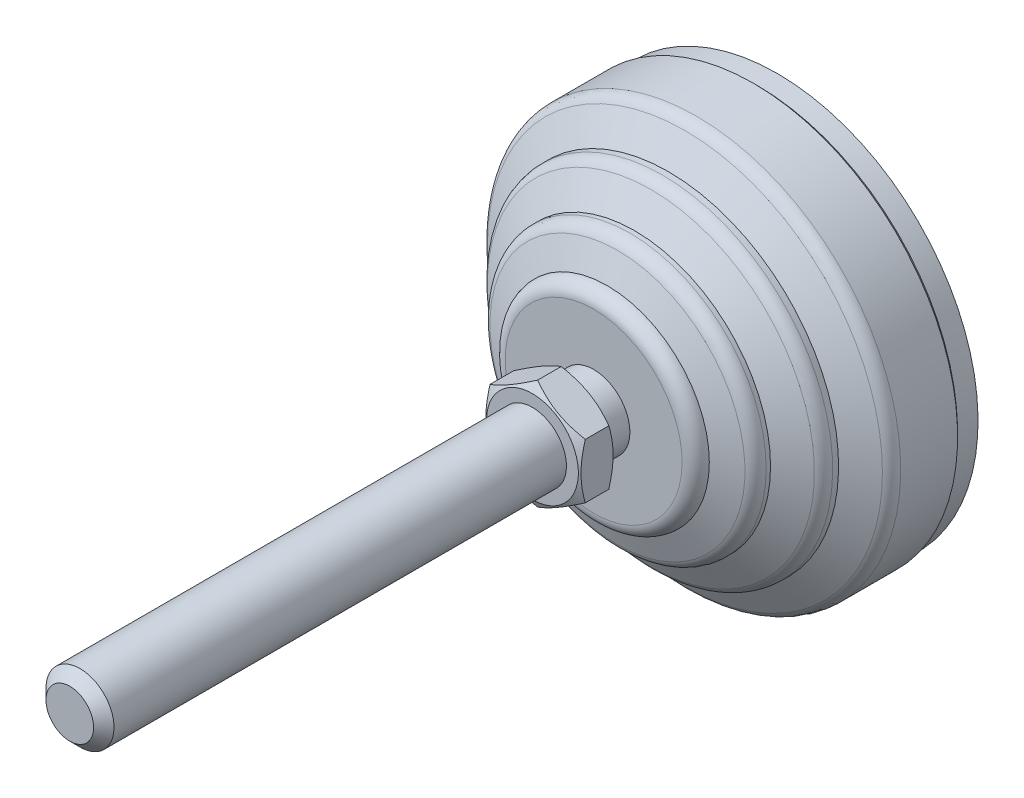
ISO-10303-21;
HEADER;
FILE_DESCRIPTION(('STEP AP214'),'2;1');
FILE_NAME('part.step','',(''),(''),'','','');
FILE_SCHEMA(('AUTOMOTIVE_DESIGN { 1 0 10303 214 1 1 1 1 }'));
ENDSEC;
DATA;
#1=APPLICATION_CONTEXT('core data for automotive mechanical design processes');
#2=APPLICATION_PROTOCOL_DEFINITION('international standard','automotive_design',2000,#1);
#3=PRODUCT_CONTEXT('',#1,'mechanical');
#4=PRODUCT('Part','Part','',(#3));
#5=PRODUCT_RELATED_PRODUCT_CATEGORY('part','',(#4));
#6=PRODUCT_DEFINITION_FORMATION('','',#4);
#7=PRODUCT_DEFINITION_CONTEXT('part definition',#1,'design');
#8=PRODUCT_DEFINITION('design','',#6,#7);
#9=PRODUCT_DEFINITION_SHAPE('','',#8);
#10=(LENGTH_UNIT() NAMED_UNIT(*) SI_UNIT(.MILLI.,.METRE.));
#11=(NAMED_UNIT(*) PLANE_ANGLE_UNIT() SI_UNIT($,.RADIAN.));
#12=(NAMED_UNIT(*) SI_UNIT($,.STERADIAN.) SOLID_ANGLE_UNIT());
#13=UNCERTAINTY_MEASURE_WITH_UNIT(LENGTH_MEASURE(1.E-05),#10,'distance_accuracy_value','');
#14=(GEOMETRIC_REPRESENTATION_CONTEXT(3) GLOBAL_UNCERTAINTY_ASSIGNED_CONTEXT((#13)) GLOBAL_UNIT_ASSIGNED_CONTEXT((#10,
#11,#12)) REPRESENTATION_CONTEXT('',''));
#15=CARTESIAN_POINT('',(0.,0.,0.));
#16=DIRECTION('',(0.,0.,1.));
#17=DIRECTION('',(1.,0.,0.));
#18=AXIS2_PLACEMENT_3D('',#15,#16,#17);
#19=CARTESIAN_POINT('',(0.,0.,0.));
#20=DIRECTION('',(0.,0.,-1.));
#21=DIRECTION('',(0.,1.,0.));
#22=AXIS2_PLACEMENT_3D('',#19,#20,#21);
#23=CYLINDRICAL_SURFACE('',#22,30.);
#24=CARTESIAN_POINT('',(0.,0.,3.5000000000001));
#25=DIRECTION('',(0.,0.,-1.));
#26=DIRECTION('',(0.,1.,0.));
#27=AXIS2_PLACEMENT_3D('',#24,#25,#26);
#28=CIRCLE('',#27,30.);
#29=CARTESIAN_POINT('',(0.,30.,3.5000000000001));
#30=VERTEX_POINT('',#29);
#31=EDGE_CURVE('E137',#30,#30,#28,.T.);
#32=ORIENTED_EDGE('',*,*,#31,.F.);
#33=EDGE_LOOP('',(#32));
#34=FACE_BOUND('',#33,.T.);
#35=CARTESIAN_POINT('',(0.,0.,11.8676192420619));
#36=DIRECTION('',(0.,0.,-1.));
#37=DIRECTION('',(0.,1.,0.));
#38=AXIS2_PLACEMENT_3D('',#35,#36,#37);
#39=CIRCLE('',#38,30.);
#40=CARTESIAN_POINT('',(0.,30.,11.8676192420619));
#41=VERTEX_POINT('',#40);
#42=EDGE_CURVE('E95',#41,#41,#39,.T.);
#43=ORIENTED_EDGE('',*,*,#42,.T.);
#44=EDGE_LOOP('',(#43));
#45=FACE_BOUND('',#44,.T.);
#46=ADVANCED_FACE('F14',(#34,#45),#23,.T.);
#47=CARTESIAN_POINT('',(0.,0.,3.5000000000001));
#48=DIRECTION('',(0.,0.,1.));
#49=DIRECTION('',(0.,-1.,0.));
#50=AXIS2_PLACEMENT_3D('',#47,#48,#49);
#51=CONICAL_SURFACE('',#50,30.,0.785398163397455);
#52=CARTESIAN_POINT('',(0.,0.,3.00000000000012));
#53=DIRECTION('',(0.,0.,-1.));
#54=DIRECTION('',(0.,1.,0.));
#55=AXIS2_PLACEMENT_3D('',#52,#53,#54);
#56=CIRCLE('',#55,29.5);
#57=CARTESIAN_POINT('',(0.,29.5,3.00000000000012));
#58=VERTEX_POINT('',#57);
#59=EDGE_CURVE('E134',#58,#58,#56,.T.);
#60=ORIENTED_EDGE('',*,*,#59,.F.);
#61=EDGE_LOOP('',(#60));
#62=FACE_BOUND('',#61,.T.);
#63=ORIENTED_EDGE('',*,*,#31,.T.);
#64=EDGE_LOOP('',(#63));
#65=FACE_BOUND('',#64,.T.);
#66=ADVANCED_FACE('F291',(#62,#65),#51,.T.);
#67=CARTESIAN_POINT('',(0.,0.,0.));
#68=DIRECTION('',(0.,0.,-1.));
#69=DIRECTION('',(0.,1.,0.));
#70=AXIS2_PLACEMENT_3D('',#67,#68,#69);
#71=CYLINDRICAL_SURFACE('',#70,29.5);
#72=CARTESIAN_POINT('',(0.,0.,0.));
#73=DIRECTION('',(0.,0.,-1.));
#74=DIRECTION('',(0.,1.,0.));
#75=AXIS2_PLACEMENT_3D('',#72,#73,#74);
#76=CIRCLE('',#75,29.5);
#77=CARTESIAN_POINT('',(0.,29.5,0.));
#78=VERTEX_POINT('',#77);
#79=EDGE_CURVE('E131',#78,#78,#76,.T.);
#80=ORIENTED_EDGE('',*,*,#79,.F.);
#81=EDGE_LOOP('',(#80));
#82=FACE_BOUND('',#81,.T.);
#83=ORIENTED_EDGE('',*,*,#59,.T.);
#84=EDGE_LOOP('',(#83));
#85=FACE_BOUND('',#84,.T.);
#86=ADVANCED_FACE('F287',(#82,#85),#71,.T.);
#87=CARTESIAN_POINT('',(-29.5,0.,0.));
#88=DIRECTION('',(0.,0.,1.));
#89=DIRECTION('',(0.,-1.,0.));
#90=AXIS2_PLACEMENT_3D('',#87,#88,#89);
#91=PLANE('',#90);
#92=ORIENTED_EDGE('',*,*,#79,.T.);
#93=EDGE_LOOP('',(#92));
#94=FACE_BOUND('',#93,.T.);
#95=ADVANCED_FACE('F276',(#94),#91,.F.);
#96=CARTESIAN_POINT('',(-5.32445501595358,0.,31.));
#97=DIRECTION('',(0.,0.,1.));
#98=DIRECTION('',(0.,-1.,0.));
#99=AXIS2_PLACEMENT_3D('',#96,#97,#98);
#100=PLANE('',#99);
#101=CARTESIAN_POINT('',(0.,0.,31.));
#102=DIRECTION('',(0.,0.,-1.));
#103=DIRECTION('',(-1.,0.,0.));
#104=AXIS2_PLACEMENT_3D('',#101,#102,#103);
#105=CIRCLE('',#104,6.75);
#106=CARTESIAN_POINT('',(-6.75,0.,31.));
#107=VERTEX_POINT('',#106);
#108=EDGE_CURVE('E532',#107,#107,#105,.T.);
#109=ORIENTED_EDGE('',*,*,#108,.T.);
#110=EDGE_LOOP('',(#109));
#111=FACE_BOUND('',#110,.T.);
#112=CARTESIAN_POINT('',(0.,0.,31.));
#113=DIRECTION('',(0.,0.,-1.));
#114=DIRECTION('',(0.,1.,0.));
#115=AXIS2_PLACEMENT_3D('',#112,#113,#114);
#116=CIRCLE('',#115,5.32445501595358);
#117=CARTESIAN_POINT('',(0.,5.32445501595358,31.));
#118=VERTEX_POINT('',#117);
#119=EDGE_CURVE('E128',#118,#118,#116,.T.);
#120=ORIENTED_EDGE('',*,*,#119,.F.);
#121=EDGE_LOOP('',(#120));
#122=FACE_BOUND('',#121,.T.);
#123=ADVANCED_FACE('F272',(#111,#122),#100,.F.);
#124=CARTESIAN_POINT('',(0.,0.,0.));
#125=DIRECTION('',(0.,0.,-1.));
#126=DIRECTION('',(0.,1.,0.));
#127=AXIS2_PLACEMENT_3D('',#124,#125,#126);
#128=CYLINDRICAL_SURFACE('',#127,5.32445501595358);
#129=CARTESIAN_POINT('',(0.,0.,27.));
#130=DIRECTION('',(0.,0.,-1.));
#131=DIRECTION('',(0.,1.,0.));
#132=AXIS2_PLACEMENT_3D('',#129,#130,#131);
#133=CIRCLE('',#132,5.32445501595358);
#134=CARTESIAN_POINT('',(0.,5.32445501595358,27.));
#135=VERTEX_POINT('',#134);
#136=EDGE_CURVE('E125',#135,#135,#133,.T.);
#137=ORIENTED_EDGE('',*,*,#136,.F.);
#138=EDGE_LOOP('',(#137));
#139=FACE_BOUND('',#138,.T.);
#140=ORIENTED_EDGE('',*,*,#119,.T.);
#141=EDGE_LOOP('',(#140));
#142=FACE_BOUND('',#141,.T.);
#143=ADVANCED_FACE('F268',(#139,#142),#128,.T.);
#144=CARTESIAN_POINT('',(-13.,0.,27.));
#145=DIRECTION('',(0.,0.,-1.));
#146=DIRECTION('',(0.,1.,0.));
#147=AXIS2_PLACEMENT_3D('',#144,#145,#146);
#148=PLANE('',#147);
#149=CARTESIAN_POINT('',(0.,0.,27.));
#150=DIRECTION('',(0.,0.,-1.));
#151=DIRECTION('',(0.,1.,0.));
#152=AXIS2_PLACEMENT_3D('',#149,#150,#151);
#153=CIRCLE('',#152,13.);
#154=CARTESIAN_POINT('',(0.,13.,27.));
#155=VERTEX_POINT('',#154);
#156=EDGE_CURVE('E122',#155,#155,#153,.T.);
#157=ORIENTED_EDGE('',*,*,#156,.F.);
#158=EDGE_LOOP('',(#157));
#159=FACE_BOUND('',#158,.T.);
#160=ORIENTED_EDGE('',*,*,#136,.T.);
#161=EDGE_LOOP('',(#160));
#162=FACE_BOUND('',#161,.T.);
#163=ADVANCED_FACE('F264',(#159,#162),#148,.F.);
#164=CARTESIAN_POINT('',(0.,0.,25.));
#165=DIRECTION('',(0.,0.,-1.));
#166=DIRECTION('',(0.,1.,0.));
#167=AXIS2_PLACEMENT_3D('',#164,#165,#166);
#168=TOROIDAL_SURFACE('',#167,13.,2.);
#169=CARTESIAN_POINT('',(0.,0.,25.));
#170=DIRECTION('',(0.,0.,-1.));
#171=DIRECTION('',(0.,1.,0.));
#172=AXIS2_PLACEMENT_3D('',#169,#170,#171);
#173=CIRCLE('',#172,15.);
#174=CARTESIAN_POINT('',(0.,15.,25.));
#175=VERTEX_POINT('',#174);
#176=EDGE_CURVE('E119',#175,#175,#173,.T.);
#177=ORIENTED_EDGE('',*,*,#176,.F.);
#178=EDGE_LOOP('',(#177));
#179=FACE_BOUND('',#178,.T.);
#180=ORIENTED_EDGE('',*,*,#156,.T.);
#181=EDGE_LOOP('',(#180));
#182=FACE_BOUND('',#181,.T.);
#183=ADVANCED_FACE('F260',(#179,#182),#168,.T.);
#184=CARTESIAN_POINT('',(0.,0.,25.));
#185=DIRECTION('',(0.,0.,-1.));
#186=DIRECTION('',(0.,1.,0.));
#187=AXIS2_PLACEMENT_3D('',#184,#185,#186);
#188=CONICAL_SURFACE('',#187,15.,1.19028994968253);
#189=CARTESIAN_POINT('',(0.,0.,23.5028874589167));
#190=DIRECTION('',(0.,0.,-1.));
#191=DIRECTION('',(0.,1.,0.));
#192=AXIS2_PLACEMENT_3D('',#189,#190,#191);
#193=CIRCLE('',#192,18.7427813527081);
#194=CARTESIAN_POINT('',(0.,18.7427813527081,23.5028874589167));
#195=VERTEX_POINT('',#194);
#196=EDGE_CURVE('E116',#195,#195,#193,.T.);
#197=ORIENTED_EDGE('',*,*,#196,.F.);
#198=EDGE_LOOP('',(#197));
#199=FACE_BOUND('',#198,.T.);
#200=ORIENTED_EDGE('',*,*,#176,.T.);
#201=EDGE_LOOP('',(#200));
#202=FACE_BOUND('',#201,.T.);
#203=ADVANCED_FACE('F256',(#199,#202),#188,.T.);
#204=CARTESIAN_POINT('',(0.,0.,21.6459340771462));
#205=DIRECTION('',(0.,0.,-1.));
#206=DIRECTION('',(0.,1.,0.));
#207=AXIS2_PLACEMENT_3D('',#204,#205,#206);
#208=TOROIDAL_SURFACE('',#207,18.,2.00000000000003);
#209=CARTESIAN_POINT('',(0.,0.,21.6459340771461));
#210=DIRECTION('',(0.,0.,-1.));
#211=DIRECTION('',(0.,1.,0.));
#212=AXIS2_PLACEMENT_3D('',#209,#210,#211);
#213=CIRCLE('',#212,20.);
#214=CARTESIAN_POINT('',(0.,20.,21.6459340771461));
#215=VERTEX_POINT('',#214);
#216=EDGE_CURVE('E113',#215,#215,#213,.T.);
#217=ORIENTED_EDGE('',*,*,#216,.F.);
#218=EDGE_LOOP('',(#217));
#219=FACE_BOUND('',#218,.T.);
#220=ORIENTED_EDGE('',*,*,#196,.T.);
#221=EDGE_LOOP('',(#220));
#222=FACE_BOUND('',#221,.T.);
#223=ADVANCED_FACE('F252',(#219,#222),#208,.T.);
#224=CARTESIAN_POINT('',(0.,0.,0.));
#225=DIRECTION('',(0.,0.,-1.));
#226=DIRECTION('',(0.,1.,0.));
#227=AXIS2_PLACEMENT_3D('',#224,#225,#226);
#228=CYLINDRICAL_SURFACE('',#227,20.);
#229=CARTESIAN_POINT('',(0.,0.,21.));
#230=DIRECTION('',(0.,0.,-1.));
#231=DIRECTION('',(0.,1.,0.));
#232=AXIS2_PLACEMENT_3D('',#229,#230,#231);
#233=CIRCLE('',#232,20.);
#234=CARTESIAN_POINT('',(0.,20.,21.));
#235=VERTEX_POINT('',#234);
#236=EDGE_CURVE('E110',#235,#235,#233,.T.);
#237=ORIENTED_EDGE('',*,*,#236,.F.);
#238=EDGE_LOOP('',(#237));
#239=FACE_BOUND('',#238,.T.);
#240=ORIENTED_EDGE('',*,*,#216,.T.);
#241=EDGE_LOOP('',(#240));
#242=FACE_BOUND('',#241,.T.);
#243=ADVANCED_FACE('F248',(#239,#242),#228,.T.);
#244=CARTESIAN_POINT('',(0.,0.,21.));
#245=DIRECTION('',(0.,0.,-1.));
#246=DIRECTION('',(0.,1.,0.));
#247=AXIS2_PLACEMENT_3D('',#244,#245,#246);
#248=CONICAL_SURFACE('',#247,20.,1.03037682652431);
#249=CARTESIAN_POINT('',(0.,0.,18.582605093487));
#250=DIRECTION('',(0.,0.,-1.));
#251=DIRECTION('',(0.,1.,0.));
#252=AXIS2_PLACEMENT_3D('',#249,#250,#251);
#253=CIRCLE('',#252,24.0289915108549);
#254=CARTESIAN_POINT('',(0.,24.0289915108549,18.582605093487));
#255=VERTEX_POINT('',#254);
#256=EDGE_CURVE('E107',#255,#255,#253,.T.);
#257=ORIENTED_EDGE('',*,*,#256,.F.);
#258=EDGE_LOOP('',(#257));
#259=FACE_BOUND('',#258,.T.);
#260=ORIENTED_EDGE('',*,*,#236,.T.);
#261=EDGE_LOOP('',(#260));
#262=FACE_BOUND('',#261,.T.);
#263=ADVANCED_FACE('F244',(#259,#262),#248,.T.);
#264=CARTESIAN_POINT('',(0.,0.,16.8676192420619));
#265=DIRECTION('',(0.,0.,-1.));
#266=DIRECTION('',(0.,1.,0.));
#267=AXIS2_PLACEMENT_3D('',#264,#265,#266);
#268=TOROIDAL_SURFACE('',#267,23.,2.00000000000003);
#269=CARTESIAN_POINT('',(0.,0.,16.8676192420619));
#270=DIRECTION('',(0.,0.,-1.));
#271=DIRECTION('',(0.,1.,0.));
#272=AXIS2_PLACEMENT_3D('',#269,#270,#271);
#273=CIRCLE('',#272,25.);
#274=CARTESIAN_POINT('',(0.,25.,16.8676192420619));
#275=VERTEX_POINT('',#274);
#276=EDGE_CURVE('E104',#275,#275,#273,.T.);
#277=ORIENTED_EDGE('',*,*,#276,.F.);
#278=EDGE_LOOP('',(#277));
#279=FACE_BOUND('',#278,.T.);
#280=ORIENTED_EDGE('',*,*,#256,.T.);
#281=EDGE_LOOP('',(#280));
#282=FACE_BOUND('',#281,.T.);
#283=ADVANCED_FACE('F240',(#279,#282),#268,.T.);
#284=CARTESIAN_POINT('',(0.,0.,0.));
#285=DIRECTION('',(0.,0.,-1.));
#286=DIRECTION('',(0.,1.,0.));
#287=AXIS2_PLACEMENT_3D('',#284,#285,#286);
#288=CYLINDRICAL_SURFACE('',#287,25.);
#289=CARTESIAN_POINT('',(0.,0.,16.));
#290=DIRECTION('',(0.,0.,-1.));
#291=DIRECTION('',(0.,1.,0.));
#292=AXIS2_PLACEMENT_3D('',#289,#290,#291);
#293=CIRCLE('',#292,25.);
#294=CARTESIAN_POINT('',(0.,25.,16.));
#295=VERTEX_POINT('',#294);
#296=EDGE_CURVE('E101',#295,#295,#293,.T.);
#297=ORIENTED_EDGE('',*,*,#296,.F.);
#298=EDGE_LOOP('',(#297));
#299=FACE_BOUND('',#298,.T.);
#300=ORIENTED_EDGE('',*,*,#276,.T.);
#301=EDGE_LOOP('',(#300));
#302=FACE_BOUND('',#301,.T.);
#303=ADVANCED_FACE('F236',(#299,#302),#288,.T.);
#304=CARTESIAN_POINT('',(0.,0.,16.));
#305=DIRECTION('',(0.,0.,-1.));
#306=DIRECTION('',(0.,1.,0.));
#307=AXIS2_PLACEMENT_3D('',#304,#305,#306);
#308=CONICAL_SURFACE('',#307,25.,1.03037682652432);
#309=CARTESIAN_POINT('',(0.,0.,13.582605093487));
#310=DIRECTION('',(0.,0.,-1.));
#311=DIRECTION('',(0.,1.,0.));
#312=AXIS2_PLACEMENT_3D('',#309,#310,#311);
#313=CIRCLE('',#312,29.028991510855);
#314=CARTESIAN_POINT('',(0.,29.028991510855,13.582605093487));
#315=VERTEX_POINT('',#314);
#316=EDGE_CURVE('E98',#315,#315,#313,.T.);
#317=ORIENTED_EDGE('',*,*,#316,.F.);
#318=EDGE_LOOP('',(#317));
#319=FACE_BOUND('',#318,.T.);
#320=ORIENTED_EDGE('',*,*,#296,.T.);
#321=EDGE_LOOP('',(#320));
#322=FACE_BOUND('',#321,.T.);
#323=ADVANCED_FACE('F232',(#319,#322),#308,.T.);
#324=CARTESIAN_POINT('',(0.,0.,11.8676192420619));
#325=DIRECTION('',(0.,0.,-1.));
#326=DIRECTION('',(0.,1.,0.));
#327=AXIS2_PLACEMENT_3D('',#324,#325,#326);
#328=TOROIDAL_SURFACE('',#327,28.,2.00000000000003);
#329=ORIENTED_EDGE('',*,*,#42,.F.);
#330=EDGE_LOOP('',(#329));
#331=FACE_BOUND('',#330,.T.);
#332=ORIENTED_EDGE('',*,*,#316,.T.);
#333=EDGE_LOOP('',(#332));
#334=FACE_BOUND('',#333,.T.);
#335=ADVANCED_FACE('F228',(#331,#334),#328,.T.);
#336=CARTESIAN_POINT('',(0.,0.,32.3365734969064));
#337=DIRECTION('',(0.,0.,1.));
#338=DIRECTION('',(1.,0.,0.));
#339=AXIS2_PLACEMENT_3D('',#336,#337,#338);
#340=CONICAL_SURFACE('',#339,9.06501320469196,1.0471975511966);
#341=CARTESIAN_POINT('',(0.258366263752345,-8.2320716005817,31.8580147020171));
#342=CARTESIAN_POINT('',(-0.0683040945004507,-8.04346838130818,31.743248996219));
#343=CARTESIAN_POINT('',(-0.398029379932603,-7.8531013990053,31.638205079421));
#344=CARTESIAN_POINT('',(-1.06386147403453,-7.46868306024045,31.4537766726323));
#345=CARTESIAN_POINT('',(-1.39998516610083,-7.27462195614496,31.3744743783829));
#346=CARTESIAN_POINT('',(-1.90275281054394,-6.9843489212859,31.2809363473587));
#347=CARTESIAN_POINT('',(-2.06764796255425,-6.88914666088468,31.2542132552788));
#348=CARTESIAN_POINT('',(-2.39830212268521,-6.69824339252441,31.2091178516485));
#349=CARTESIAN_POINT('',(-2.56406113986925,-6.6025423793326,31.1907456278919));
#350=CARTESIAN_POINT('',(-2.89587313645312,-6.41097063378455,31.1628762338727));
#351=CARTESIAN_POINT('',(-3.06192520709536,-6.31510042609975,31.1533647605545));
#352=CARTESIAN_POINT('',(-3.39423422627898,-6.12324172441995,31.1434376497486));
#353=CARTESIAN_POINT('',(-3.56049117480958,-6.02725323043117,31.1430220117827));
#354=CARTESIAN_POINT('',(-3.90317022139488,-5.82940739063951,31.1515585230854));
#355=CARTESIAN_POINT('',(-4.07958150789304,-5.7275562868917,31.1610948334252));
#356=CARTESIAN_POINT('',(-4.43178593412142,-5.52421096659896,31.1901382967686));
#357=CARTESIAN_POINT('',(-4.60757905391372,-5.4227167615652,31.2096457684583));
#358=CARTESIAN_POINT('',(-4.95851569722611,-5.22010339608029,31.2580823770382));
#359=CARTESIAN_POINT('',(-5.13365737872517,-5.11898529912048,31.2870291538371));
#360=CARTESIAN_POINT('',(-5.482711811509,-4.9174586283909,31.3535411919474));
#361=CARTESIAN_POINT('',(-5.65662447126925,-4.81705010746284,31.391107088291));
#362=CARTESIAN_POINT('',(-6.00858611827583,-4.61384495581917,31.4752817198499));
#363=CARTESIAN_POINT('',(-6.18658989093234,-4.51107442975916,31.5221408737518));
#364=CARTESIAN_POINT('',(-6.54106505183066,-4.30641810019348,31.6230819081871));
#365=CARTESIAN_POINT('',(-6.71753627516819,-4.20453239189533,31.6771645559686));
#366=CARTESIAN_POINT('',(-7.06821322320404,-4.00206896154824,31.791349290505));
#367=CARTESIAN_POINT('',(-7.24242530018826,-3.90148757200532,31.8514255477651));
#368=CARTESIAN_POINT('',(-7.58933123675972,-3.7012013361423,31.9769213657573));
#369=CARTESIAN_POINT('',(-7.76202564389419,-3.60149617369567,32.0423389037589));
#370=CARTESIAN_POINT('',(-7.93403067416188,-3.50218902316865,32.1100196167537));
#371=B_SPLINE_CURVE_WITH_KNOTS('',3,(#341,#342,#343,#344,#345,#346,#347,#348,#349,#350,#351,
#352,#353,#354,#355,#356,#357,#358,#359,#360,#361,#362,#363,#364,#365,#366,#367,#368,#369,#370),
.UNSPECIFIED.,.F.,.F.,(4,2,2,2,2,2,2,2,2,2,2,2,2,2,4),(0.,1.18358157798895,2.37090610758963,
2.94754918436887,3.52419832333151,4.09991501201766,4.67563167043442,5.28715036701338,
5.89868860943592,6.51137629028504,7.12410912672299,7.7564046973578,8.38876748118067,
9.01851403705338,9.64802320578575),.UNSPECIFIED.);
#372=CARTESIAN_POINT('',(0.,-8.08290376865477,31.7695523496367));
#373=VERTEX_POINT('',#372);
#374=CARTESIAN_POINT('',(-7.,-4.04145188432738,31.7695523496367));
#375=VERTEX_POINT('',#374);
#376=EDGE_CURVE('E73',#373,#375,#371,.T.);
#377=ORIENTED_EDGE('',*,*,#376,.T.);
#378=CARTESIAN_POINT('',(-7.,-10.7772641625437,34.5224414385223));
#379=CARTESIAN_POINT('',(-7.,-10.4721759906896,34.3747640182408));
#380=CARTESIAN_POINT('',(-7.,-10.1663789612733,34.2285255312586));
#381=CARTESIAN_POINT('',(-7.,-9.55298989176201,33.9397373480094));
#382=CARTESIAN_POINT('',(-7.,-9.24539757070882,33.7971882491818));
#383=CARTESIAN_POINT('',(-7.,-8.62641777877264,33.5158557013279));
#384=CARTESIAN_POINT('',(-7.,-8.31501870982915,33.3770976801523));
#385=CARTESIAN_POINT('',(-7.,-7.68971614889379,33.1053662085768));
#386=CARTESIAN_POINT('',(-7.,-7.37581277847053,32.9723924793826));
#387=CARTESIAN_POINT('',(-7.,-6.73518250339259,32.7097333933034));
#388=CARTESIAN_POINT('',(-7.,-6.40836040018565,32.5802789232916));
#389=CARTESIAN_POINT('',(-7.,-5.75086448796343,32.3313592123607));
#390=CARTESIAN_POINT('',(-7.,-5.42019024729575,32.2118951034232));
#391=CARTESIAN_POINT('',(-7.,-4.75510473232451,31.9861504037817));
#392=CARTESIAN_POINT('',(-7.,-4.42070285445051,31.8798424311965));
#393=CARTESIAN_POINT('',(-7.,-3.74711561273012,31.68387134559));
#394=CARTESIAN_POINT('',(-7.,-3.40793181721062,31.5942029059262));
#395=CARTESIAN_POINT('',(-7.,-2.72639599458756,31.4363436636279));
#396=CARTESIAN_POINT('',(-7.,-2.38407095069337,31.3680395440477));
#397=CARTESIAN_POINT('',(-7.,-1.86752994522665,31.2846031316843));
#398=CARTESIAN_POINT('',(-7.,-1.69482740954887,31.2599598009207));
#399=CARTESIAN_POINT('',(-7.,-1.34859091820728,31.2174981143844));
#400=CARTESIAN_POINT('',(-7.,-1.17505704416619,31.1996791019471));
#401=CARTESIAN_POINT('',(-7.,-0.829622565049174,31.1714405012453));
#402=CARTESIAN_POINT('',(-7.,-0.657729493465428,31.1609291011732));
#403=CARTESIAN_POINT('',(-7.,-0.313653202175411,31.1471790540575));
#404=CARTESIAN_POINT('',(-7.,-0.141469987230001,31.1439402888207));
#405=CARTESIAN_POINT('',(-7.,0.202879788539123,31.1448126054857));
#406=CARTESIAN_POINT('',(-7.,0.375046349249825,31.1489237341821));
#407=CARTESIAN_POINT('',(-7.,0.71905563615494,31.1643967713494));
#408=CARTESIAN_POINT('',(-7.,0.890898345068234,31.1757590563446));
#409=CARTESIAN_POINT('',(-7.,1.3063006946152,31.2117523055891));
#410=CARTESIAN_POINT('',(-7.,1.54955692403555,31.2399574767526));
#411=CARTESIAN_POINT('',(-7.,2.03420042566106,31.3093406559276));
#412=CARTESIAN_POINT('',(-7.,2.27558742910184,31.3505204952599));
#413=CARTESIAN_POINT('',(-7.,2.9967043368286,31.491332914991));
#414=CARTESIAN_POINT('',(-7.,3.47310776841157,31.6082107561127));
#415=CARTESIAN_POINT('',(-7.,4.18535741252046,31.8100845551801));
#416=CARTESIAN_POINT('',(-7.,4.42491788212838,31.8827227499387));
#417=CARTESIAN_POINT('',(-7.,4.90171078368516,32.03534326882));
#418=CARTESIAN_POINT('',(-7.,5.13894320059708,32.1153256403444));
#419=CARTESIAN_POINT('',(-7.,5.61115854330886,32.2813679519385));
#420=CARTESIAN_POINT('',(-7.,5.84614222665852,32.3674257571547));
#421=CARTESIAN_POINT('',(-7.,6.31417626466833,32.5446264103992));
#422=CARTESIAN_POINT('',(-7.,6.54722663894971,32.635769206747));
#423=CARTESIAN_POINT('',(-7.,7.08445600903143,32.8515506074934));
#424=CARTESIAN_POINT('',(-7.,7.38801561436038,32.9777281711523));
#425=CARTESIAN_POINT('',(-7.,7.99266206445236,33.2358912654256));
#426=CARTESIAN_POINT('',(-7.,8.29374877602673,33.3678771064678));
#427=CARTESIAN_POINT('',(-7.,8.89388807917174,33.6365251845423));
#428=CARTESIAN_POINT('',(-7.,9.19294029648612,33.7731882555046));
#429=CARTESIAN_POINT('',(-7.,9.78929637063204,34.0502837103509));
#430=CARTESIAN_POINT('',(-7.,10.0866001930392,34.1907161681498));
#431=CARTESIAN_POINT('',(-7.,10.68002233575,34.474799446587));
#432=CARTESIAN_POINT('',(-7.,10.9761392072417,34.6184532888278));
#433=CARTESIAN_POINT('',(-7.,11.5671224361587,34.908312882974));
#434=CARTESIAN_POINT('',(-7.,11.8619887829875,35.0545186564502));
#435=CARTESIAN_POINT('',(-7.,12.7449324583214,35.4962683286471));
#436=CARTESIAN_POINT('',(-7.,13.3314253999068,35.7949788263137));
#437=CARTESIAN_POINT('',(-7.,14.4543904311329,36.374191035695));
#438=CARTESIAN_POINT('',(-7.,14.9911014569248,36.6542315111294));
#439=CARTESIAN_POINT('',(-7.,16.0625203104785,37.2181564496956));
#440=CARTESIAN_POINT('',(-7.,16.5972280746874,37.5020410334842));
#441=CARTESIAN_POINT('',(-7.,17.6638395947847,38.0720929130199));
#442=CARTESIAN_POINT('',(-7.,18.1957469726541,38.3582534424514));
#443=CARTESIAN_POINT('',(-7.,19.2582732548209,38.9328930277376));
#444=CARTESIAN_POINT('',(-7.,19.7888922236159,39.2213719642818));
#445=CARTESIAN_POINT('',(-7.,20.3190332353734,39.5107207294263));
#446=B_SPLINE_CURVE_WITH_KNOTS('',3,(#378,#379,#380,#381,#382,#383,#384,#385,#386,#387,#388,
#389,#390,#391,#392,#393,#394,#395,#396,#397,#398,#399,#400,#401,#402,#403,#404,#405,#406,#407,
#408,#409,#410,#411,#412,#413,#414,#415,#416,#417,#418,#419,#420,#421,#422,#423,#424,#425,#426,
#427,#428,#429,#430,#431,#432,#433,#434,#435,#436,#437,#438,#439,#440,#441,#442,#443,#444,#445),
.UNSPECIFIED.,.F.,.F.,(4,2,2,2,2,2,2,2,2,2,2,2,2,2,2,2,2,2,2,2,2,2,2,2,2,2,2,2,2,2,2,2,2,4),(0.,
1.01686417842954,2.03389200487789,3.05659049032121,4.0792396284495,5.1336935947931,
6.18826687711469,7.24060698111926,8.29260962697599,9.33893389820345,9.86217588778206,
10.3853675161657,10.901860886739,11.4183458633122,11.9348341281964,12.4513492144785,
13.1855904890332,13.9199354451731,15.3894727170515,16.1404052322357,16.8913425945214,
17.6420173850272,18.3926845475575,19.3788209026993,20.3650100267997,21.3513759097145,
22.3377611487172,23.3251138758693,24.3124749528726,26.2869607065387,28.1030752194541,
29.9192468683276,31.731234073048,33.5431286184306),.UNSPECIFIED.);
#447=CARTESIAN_POINT('',(-7.,4.04145188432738,31.7695523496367));
#448=VERTEX_POINT('',#447);
#449=EDGE_CURVE('E81',#375,#448,#446,.T.);
#450=ORIENTED_EDGE('',*,*,#449,.T.);
#451=CARTESIAN_POINT('',(-12.6485518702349,0.780258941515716,34.4194119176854));
#452=CARTESIAN_POINT('',(-12.3807495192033,0.934874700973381,34.2706319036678));
#453=CARTESIAN_POINT('',(-12.1122923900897,1.089868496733,34.1233931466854));
#454=CARTESIAN_POINT('',(-11.5737081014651,1.40082028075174,33.8328951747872));
#455=CARTESIAN_POINT('',(-11.3035806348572,1.55677844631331,33.6896367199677));
#456=CARTESIAN_POINT('',(-10.7596826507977,1.87079809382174,33.4071634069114));
#457=CARTESIAN_POINT('',(-10.4858998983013,2.02886663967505,33.2679798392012));
#458=CARTESIAN_POINT('',(-9.93599790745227,2.34635270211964,32.9959347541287));
#459=CARTESIAN_POINT('',(-9.65987880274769,2.50577014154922,32.8630728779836));
#460=CARTESIAN_POINT('',(-9.10239796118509,2.82763185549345,32.6042585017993));
#461=CARTESIAN_POINT('',(-8.82101149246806,2.99009040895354,32.478376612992));
#462=CARTESIAN_POINT('',(-8.25481583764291,3.31698362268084,32.2371213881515));
#463=CARTESIAN_POINT('',(-7.97000624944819,3.48141851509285,32.1217493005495));
#464=CARTESIAN_POINT('',(-7.39717564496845,3.81214241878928,31.9048555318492));
#465=CARTESIAN_POINT('',(-7.10916404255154,3.97842599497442,31.8033010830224));
#466=CARTESIAN_POINT('',(-6.52902258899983,4.31337081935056,31.6175671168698));
#467=CARTESIAN_POINT('',(-6.23689419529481,4.48203122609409,31.5333816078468));
#468=CARTESIAN_POINT('',(-5.65202235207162,4.81970714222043,31.3876761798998));
#469=CARTESIAN_POINT('',(-5.35932940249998,4.98869349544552,31.3258935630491));
#470=CARTESIAN_POINT('',(-4.91790706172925,5.24354880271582,31.2523221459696));
#471=CARTESIAN_POINT('',(-4.77034954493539,5.3287411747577,31.2309805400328));
#472=CARTESIAN_POINT('',(-4.47462095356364,5.49948015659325,31.1950879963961));
#473=CARTESIAN_POINT('',(-4.32644993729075,5.58502673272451,31.1805364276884));
#474=CARTESIAN_POINT('',(-4.0305217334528,5.75588096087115,31.1586057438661));
#475=CARTESIAN_POINT('',(-3.88276670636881,5.84118736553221,31.1511878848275));
#476=CARTESIAN_POINT('',(-3.58711810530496,6.01188016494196,31.143555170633));
#477=CARTESIAN_POINT('',(-3.43922453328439,6.09726655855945,31.1433402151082));
#478=CARTESIAN_POINT('',(-3.14359813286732,6.26794654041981,31.1501182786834));
#479=CARTESIAN_POINT('',(-2.99586527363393,6.35324014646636,31.1571095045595));
#480=CARTESIAN_POINT('',(-2.70077359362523,6.523611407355,31.1781349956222));
#481=CARTESIAN_POINT('',(-2.55341479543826,6.60868904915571,31.1921696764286));
#482=CARTESIAN_POINT('',(-2.18909339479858,6.81903010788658,31.2352945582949));
#483=CARTESIAN_POINT('',(-1.97247867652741,6.94409267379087,31.2683734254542));
#484=CARTESIAN_POINT('',(-1.54109682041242,7.19315110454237,31.3478453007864));
#485=CARTESIAN_POINT('',(-1.32632999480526,7.31714678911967,31.3942405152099));
#486=CARTESIAN_POINT('',(-0.684350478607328,7.68779383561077,31.5510524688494));
#487=CARTESIAN_POINT('',(-0.260316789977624,7.9326097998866,31.678981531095));
#488=CARTESIAN_POINT('',(0.373559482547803,8.29857843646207,31.8973652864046));
#489=CARTESIAN_POINT('',(0.586756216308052,8.4216676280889,31.9755588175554));
#490=CARTESIAN_POINT('',(1.01109162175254,8.66665778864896,32.1391980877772));
#491=CARTESIAN_POINT('',(1.22223011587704,8.78855865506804,32.2246444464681));
#492=CARTESIAN_POINT('',(1.6413892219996,9.03056027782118,32.4010007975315));
#493=CARTESIAN_POINT('',(1.84942079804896,9.15066736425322,32.4918763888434));
#494=CARTESIAN_POINT('',(2.26374969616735,9.38988026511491,32.6785362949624));
#495=CARTESIAN_POINT('',(2.47004756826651,9.50898639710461,32.774318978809));
#496=CARTESIAN_POINT('',(2.67562113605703,9.62767435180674,32.8720872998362));
#497=B_SPLINE_CURVE_WITH_KNOTS('',3,(#451,#452,#453,#454,#455,#456,#457,#458,#459,#460,#461,
#462,#463,#464,#465,#466,#467,#468,#469,#470,#471,#472,#473,#474,#475,#476,#477,#478,#479,#480,
#481,#482,#483,#484,#485,#486,#487,#488,#489,#490,#491,#492,#493,#494,#495,#496),.UNSPECIFIED.,
.F.,.F.,(4,2,2,2,2,2,2,2,2,2,2,2,2,2,2,2,2,2,2,2,2,2,4),(0.,1.02949896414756,2.05919319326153,
3.09539736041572,4.1315426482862,5.17675218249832,6.22208571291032,7.26489540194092,
8.30734475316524,9.33714155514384,9.85217558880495,10.3671617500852,10.8793349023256,
11.3915009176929,11.903539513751,12.415608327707,13.1720817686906,13.9286806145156,
15.4448571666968,16.2196994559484,16.9946080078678,17.7650415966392,18.5352207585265),.UNSPECIFIED.);
#498=CARTESIAN_POINT('',(0.,8.08290376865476,31.7695523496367));
#499=VERTEX_POINT('',#498);
#500=EDGE_CURVE('E215',#448,#499,#497,.T.);
#501=ORIENTED_EDGE('',*,*,#500,.T.);
#502=CARTESIAN_POINT('',(-0.939761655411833,8.62547541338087,32.1122761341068));
#503=CARTESIAN_POINT('',(-0.767674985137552,8.52612112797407,32.0445063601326));
#504=CARTESIAN_POINT('',(-0.594898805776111,8.42636875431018,31.978998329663));
#505=CARTESIAN_POINT('',(-0.247828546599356,8.22598764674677,31.8533190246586));
#506=CARTESIAN_POINT('',(-0.0735339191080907,8.12535859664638,31.7931497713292));
#507=CARTESIAN_POINT('',(0.277311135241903,7.92279811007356,31.678776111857));
#508=CARTESIAN_POINT('',(0.453867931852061,7.82086299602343,31.6245975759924));
#509=CARTESIAN_POINT('',(0.808516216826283,7.61610671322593,31.52346371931));
#510=CARTESIAN_POINT('',(0.986607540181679,7.51328563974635,31.476507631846));
#511=CARTESIAN_POINT('',(1.33874143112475,7.30998104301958,31.3921432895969));
#512=CARTESIAN_POINT('',(1.51273867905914,7.20952368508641,31.3544844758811));
#513=CARTESIAN_POINT('',(1.86196538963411,7.00789754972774,31.2877888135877));
#514=CARTESIAN_POINT('',(2.03719476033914,6.90672882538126,31.2587513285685));
#515=CARTESIAN_POINT('',(2.38830982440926,6.70401244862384,31.2101382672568));
#516=CARTESIAN_POINT('',(2.5641936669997,6.60246586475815,31.1905450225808));
#517=CARTESIAN_POINT('',(2.91658316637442,6.39901369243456,31.1613375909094));
#518=CARTESIAN_POINT('',(3.09308880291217,6.297108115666,31.1517230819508));
#519=CARTESIAN_POINT('',(3.43579315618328,6.09924766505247,31.1430488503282));
#520=CARTESIAN_POINT('',(3.60198071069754,6.00329923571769,31.1433955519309));
#521=CARTESIAN_POINT('',(3.93415397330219,5.81151891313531,31.1531782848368));
#522=CARTESIAN_POINT('',(4.100139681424,5.71568701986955,31.1626143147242));
#523=CARTESIAN_POINT('',(4.43182157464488,5.52419038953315,31.1903284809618));
#524=CARTESIAN_POINT('',(4.59751685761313,5.42852617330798,31.2086208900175));
#525=CARTESIAN_POINT('',(4.92804652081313,5.2376947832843,31.2535545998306));
#526=CARTESIAN_POINT('',(5.09288091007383,5.14252760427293,31.2801958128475));
#527=CARTESIAN_POINT('',(5.59545979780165,4.85236354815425,31.3734822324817));
#528=CARTESIAN_POINT('',(5.9314596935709,4.65837391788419,31.4526142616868));
#529=CARTESIAN_POINT('',(6.59705365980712,4.27409306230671,31.6367114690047));
#530=CARTESIAN_POINT('',(6.92666454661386,4.08379212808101,31.741594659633));
#531=CARTESIAN_POINT('',(7.25322108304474,3.89525462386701,31.856208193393));
#532=B_SPLINE_CURVE_WITH_KNOTS('',3,(#502,#503,#504,#505,#506,#507,#508,#509,#510,#511,#512,
#513,#514,#515,#516,#517,#518,#519,#520,#521,#522,#523,#524,#525,#526,#527,#528,#529,#530,#531),
.UNSPECIFIED.,.F.,.F.,(4,2,2,2,2,2,2,2,2,2,2,2,2,2,4),(0.,0.629863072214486,1.25996359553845,
1.89268682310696,2.52534284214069,3.13841502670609,3.75144194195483,4.36331750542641,
4.97517332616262,5.55064948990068,6.12612556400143,6.70253216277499,7.27893270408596,
8.46573413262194,9.64880489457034),.UNSPECIFIED.);
#533=CARTESIAN_POINT('',(7.,4.04145188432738,31.7695523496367));
#534=VERTEX_POINT('',#533);
#535=EDGE_CURVE('E522',#499,#534,#532,.T.);
#536=ORIENTED_EDGE('',*,*,#535,.T.);
#537=CARTESIAN_POINT('',(7.,-10.7772641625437,34.5224414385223));
#538=CARTESIAN_POINT('',(7.,-10.4721759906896,34.3747640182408));
#539=CARTESIAN_POINT('',(7.,-10.1663789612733,34.2285255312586));
#540=CARTESIAN_POINT('',(7.,-9.55298989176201,33.9397373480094));
#541=CARTESIAN_POINT('',(7.,-9.24539757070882,33.7971882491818));
#542=CARTESIAN_POINT('',(7.,-8.62641777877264,33.5158557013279));
#543=CARTESIAN_POINT('',(7.,-8.31501870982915,33.3770976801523));
#544=CARTESIAN_POINT('',(7.,-7.68971614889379,33.1053662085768));
#545=CARTESIAN_POINT('',(7.,-7.37581277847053,32.9723924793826));
#546=CARTESIAN_POINT('',(7.,-6.73518250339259,32.7097333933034));
#547=CARTESIAN_POINT('',(7.,-6.40836040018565,32.5802789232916));
#548=CARTESIAN_POINT('',(7.,-5.75086448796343,32.3313592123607));
#549=CARTESIAN_POINT('',(7.,-5.42019024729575,32.2118951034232));
#550=CARTESIAN_POINT('',(7.,-4.75510473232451,31.9861504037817));
#551=CARTESIAN_POINT('',(7.,-4.42070285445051,31.8798424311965));
#552=CARTESIAN_POINT('',(7.,-3.74711561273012,31.68387134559));
#553=CARTESIAN_POINT('',(7.,-3.40793181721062,31.5942029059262));
#554=CARTESIAN_POINT('',(7.,-2.72639599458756,31.4363436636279));
#555=CARTESIAN_POINT('',(7.,-2.38407095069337,31.3680395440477));
#556=CARTESIAN_POINT('',(7.,-1.86752994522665,31.2846031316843));
#557=CARTESIAN_POINT('',(7.,-1.69482740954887,31.2599598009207));
#558=CARTESIAN_POINT('',(7.,-1.34859091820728,31.2174981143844));
#559=CARTESIAN_POINT('',(7.,-1.17505704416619,31.1996791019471));
#560=CARTESIAN_POINT('',(7.,-0.829622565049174,31.1714405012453));
#561=CARTESIAN_POINT('',(7.,-0.657729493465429,31.1609291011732));
#562=CARTESIAN_POINT('',(7.,-0.313653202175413,31.1471790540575));
#563=CARTESIAN_POINT('',(7.,-0.141469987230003,31.1439402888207));
#564=CARTESIAN_POINT('',(7.,0.202879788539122,31.1448126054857));
#565=CARTESIAN_POINT('',(7.,0.375046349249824,31.1489237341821));
#566=CARTESIAN_POINT('',(7.,0.71905563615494,31.1643967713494));
#567=CARTESIAN_POINT('',(7.,0.890898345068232,31.1757590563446));
#568=CARTESIAN_POINT('',(7.,1.3063006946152,31.2117523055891));
#569=CARTESIAN_POINT('',(7.,1.54955692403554,31.2399574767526));
#570=CARTESIAN_POINT('',(7.,2.03420042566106,31.3093406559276));
#571=CARTESIAN_POINT('',(7.,2.27558742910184,31.3505204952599));
#572=CARTESIAN_POINT('',(7.,2.99670433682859,31.491332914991));
#573=CARTESIAN_POINT('',(7.,3.47310776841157,31.6082107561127));
#574=CARTESIAN_POINT('',(7.,4.18535741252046,31.8100845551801));
#575=CARTESIAN_POINT('',(7.,4.42491788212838,31.8827227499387));
#576=CARTESIAN_POINT('',(7.,4.90171078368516,32.03534326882));
#577=CARTESIAN_POINT('',(7.,5.13894320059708,32.1153256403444));
#578=CARTESIAN_POINT('',(7.,5.61115854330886,32.2813679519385));
#579=CARTESIAN_POINT('',(7.,5.84614222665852,32.3674257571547));
#580=CARTESIAN_POINT('',(7.,6.31417626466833,32.5446264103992));
#581=CARTESIAN_POINT('',(7.,6.54722663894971,32.635769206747));
#582=CARTESIAN_POINT('',(7.,7.08445600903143,32.8515506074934));
#583=CARTESIAN_POINT('',(7.,7.38801561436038,32.9777281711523));
#584=CARTESIAN_POINT('',(7.,7.99266206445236,33.2358912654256));
#585=CARTESIAN_POINT('',(7.,8.29374877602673,33.3678771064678));
#586=CARTESIAN_POINT('',(7.,8.89388807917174,33.6365251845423));
#587=CARTESIAN_POINT('',(7.,9.19294029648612,33.7731882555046));
#588=CARTESIAN_POINT('',(7.,9.78929637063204,34.0502837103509));
#589=CARTESIAN_POINT('',(7.,10.0866001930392,34.1907161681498));
#590=CARTESIAN_POINT('',(7.,10.68002233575,34.474799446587));
#591=CARTESIAN_POINT('',(7.,10.9761392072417,34.6184532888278));
#592=CARTESIAN_POINT('',(7.,11.5671224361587,34.908312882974));
#593=CARTESIAN_POINT('',(7.,11.8619887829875,35.0545186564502));
#594=CARTESIAN_POINT('',(7.,12.7449324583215,35.4962683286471));
#595=CARTESIAN_POINT('',(7.,13.3314253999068,35.7949788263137));
#596=CARTESIAN_POINT('',(7.,14.4543904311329,36.374191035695));
#597=CARTESIAN_POINT('',(7.,14.9911014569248,36.6542315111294));
#598=CARTESIAN_POINT('',(7.,16.0625203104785,37.2181564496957));
#599=CARTESIAN_POINT('',(7.,16.5972280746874,37.5020410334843));
#600=CARTESIAN_POINT('',(7.,17.6638395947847,38.0720929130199));
#601=CARTESIAN_POINT('',(7.,18.1957469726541,38.3582534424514));
#602=CARTESIAN_POINT('',(7.,19.258273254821,38.9328930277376));
#603=CARTESIAN_POINT('',(7.,19.7888922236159,39.2213719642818));
#604=CARTESIAN_POINT('',(7.,20.3190332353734,39.5107207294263));
#605=B_SPLINE_CURVE_WITH_KNOTS('',3,(#537,#538,#539,#540,#541,#542,#543,#544,#545,#546,#547,
#548,#549,#550,#551,#552,#553,#554,#555,#556,#557,#558,#559,#560,#561,#562,#563,#564,#565,#566,
#567,#568,#569,#570,#571,#572,#573,#574,#575,#576,#577,#578,#579,#580,#581,#582,#583,#584,#585,
#586,#587,#588,#589,#590,#591,#592,#593,#594,#595,#596,#597,#598,#599,#600,#601,#602,#603,#604),
.UNSPECIFIED.,.F.,.F.,(4,2,2,2,2,2,2,2,2,2,2,2,2,2,2,2,2,2,2,2,2,2,2,2,2,2,2,2,2,2,2,2,2,4),(0.,
1.01686417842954,2.03389200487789,3.05659049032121,4.0792396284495,5.1336935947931,
6.18826687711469,7.24060698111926,8.29260962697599,9.33893389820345,9.86217588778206,
10.3853675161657,10.901860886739,11.4183458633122,11.9348341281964,12.4513492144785,
13.1855904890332,13.9199354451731,15.3894727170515,16.1404052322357,16.8913425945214,
17.6420173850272,18.3926845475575,19.3788209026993,20.3650100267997,21.3513759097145,
22.3377611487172,23.3251138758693,24.3124749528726,26.2869607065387,28.1030752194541,
29.9192468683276,31.731234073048,33.5431286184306),.UNSPECIFIED.);
#606=CARTESIAN_POINT('',(7.,-4.04145188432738,31.7695523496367));
#607=VERTEX_POINT('',#606);
#608=EDGE_CURVE('E34',#534,#607,#605,.F.);
#609=ORIENTED_EDGE('',*,*,#608,.T.);
#610=CARTESIAN_POINT('',(-5.65202995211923,-11.3461047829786,34.4213449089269));
#611=CARTESIAN_POINT('',(-5.38425018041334,-11.1915020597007,34.2725601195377));
#612=CARTESIAN_POINT('',(-5.11581621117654,-11.0365216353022,34.1253150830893));
#613=CARTESIAN_POINT('',(-4.57727984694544,-10.725597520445,33.8348003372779));
#614=CARTESIAN_POINT('',(-4.30717714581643,-10.5696536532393,33.6915313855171));
#615=CARTESIAN_POINT('',(-3.76333434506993,-10.2556658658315,33.409033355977));
#616=CARTESIAN_POINT('',(-3.4895820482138,-10.0976149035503,33.2698354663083));
#617=CARTESIAN_POINT('',(-2.93974323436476,-9.78016531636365,32.9977540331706));
#618=CARTESIAN_POINT('',(-2.66365685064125,-9.62076676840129,32.8648701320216));
#619=CARTESIAN_POINT('',(-2.10622065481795,-9.29893083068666,32.6059901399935));
#620=CARTESIAN_POINT('',(-1.82484589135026,-9.13647903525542,32.4800652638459));
#621=CARTESIAN_POINT('',(-1.25867605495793,-8.80960072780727,32.2387121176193));
#622=CARTESIAN_POINT('',(-0.973880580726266,-8.64517398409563,32.1232850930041));
#623=CARTESIAN_POINT('',(-0.401078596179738,-8.31446660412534,31.9062656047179));
#624=CARTESIAN_POINT('',(-0.113081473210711,-8.14819138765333,31.8046404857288));
#625=CARTESIAN_POINT('',(0.467030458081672,-7.81326360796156,31.6187467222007));
#626=CARTESIAN_POINT('',(0.759143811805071,-7.64461188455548,31.5344721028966));
#627=CARTESIAN_POINT('',(1.34405110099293,-7.30691550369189,31.3885537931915));
#628=CARTESIAN_POINT('',(1.63679540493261,-7.13789950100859,31.326652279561));
#629=CARTESIAN_POINT('',(2.07829980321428,-6.88299681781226,31.2528988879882));
#630=CARTESIAN_POINT('',(2.22588547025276,-6.79778819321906,31.2314960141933));
#631=CARTESIAN_POINT('',(2.52167234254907,-6.62701556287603,31.1954808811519));
#632=CARTESIAN_POINT('',(2.66987348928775,-6.54145159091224,31.1808679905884));
#633=CARTESIAN_POINT('',(2.96586095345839,-6.37056314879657,31.1588164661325));
#634=CARTESIAN_POINT('',(3.11364509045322,-6.28523993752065,31.1513389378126));
#635=CARTESIAN_POINT('',(3.40935407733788,-6.114512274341,31.1435892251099));
#636=CARTESIAN_POINT('',(3.55727892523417,-6.02910782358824,31.1433169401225));
#637=CARTESIAN_POINT('',(3.85296977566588,-5.85839063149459,31.1499840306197));
#638=CARTESIAN_POINT('',(4.00073580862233,-5.7730778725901,31.1569216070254));
#639=CARTESIAN_POINT('',(4.29589549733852,-5.60266734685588,31.1778445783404));
#640=CARTESIAN_POINT('',(4.44328913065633,-5.51756959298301,31.1918303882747));
#641=CARTESIAN_POINT('',(4.80752237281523,-5.30727943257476,31.2348203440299));
#642=CARTESIAN_POINT('',(5.02401586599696,-5.18228685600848,31.2678045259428));
#643=CARTESIAN_POINT('',(5.45515975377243,-4.93336581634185,31.3470799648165));
#644=CARTESIAN_POINT('',(5.66980983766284,-4.80943753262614,31.3933734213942));
#645=CARTESIAN_POINT('',(6.3114437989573,-4.43898999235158,31.5498751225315));
#646=CARTESIAN_POINT('',(6.73525424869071,-4.19430291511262,31.6775911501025));
#647=CARTESIAN_POINT('',(7.36880658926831,-3.82852130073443,31.8956597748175));
#648=CARTESIAN_POINT('',(7.58190003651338,-3.70549174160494,31.9737496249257));
#649=CARTESIAN_POINT('',(8.00602977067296,-3.46062032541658,32.1371839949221));
#650=CARTESIAN_POINT('',(8.21706587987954,-3.33877857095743,32.2225291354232));
#651=CARTESIAN_POINT('',(8.63602176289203,-3.09689427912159,32.3986866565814));
#652=CARTESIAN_POINT('',(8.84395249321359,-2.97684541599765,32.489464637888));
#653=CARTESIAN_POINT('',(9.2580796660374,-2.73774898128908,32.6759319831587));
#654=CARTESIAN_POINT('',(9.46427665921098,-2.61870109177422,32.7716197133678));
#655=CARTESIAN_POINT('',(9.66974920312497,-2.5000714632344,32.8692943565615));
#656=B_SPLINE_CURVE_WITH_KNOTS('',3,(#610,#611,#612,#613,#614,#615,#616,#617,#618,#619,#620,
#621,#622,#623,#624,#625,#626,#627,#628,#629,#630,#631,#632,#633,#634,#635,#636,#637,#638,#639,
#640,#641,#642,#643,#644,#645,#646,#647,#648,#649,#650,#651,#652,#653,#654,#655),.UNSPECIFIED.,
.F.,.F.,(4,2,2,2,2,2,2,2,2,2,2,2,2,2,2,2,2,2,2,2,2,2,4),(0.,1.02943465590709,2.0590641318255,
3.09518917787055,4.13125545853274,5.1764740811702,6.22181654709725,7.26464096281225,
8.30710567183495,9.33714233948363,9.85229603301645,10.367401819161,10.8796834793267,
11.391957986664,11.9041046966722,12.4162815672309,13.1723018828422,13.9284472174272,
15.4437134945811,16.2181204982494,16.9925938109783,17.7625969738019,18.5323455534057),.UNSPECIFIED.);
#657=EDGE_CURVE('E9',#607,#373,#656,.F.);
#658=ORIENTED_EDGE('',*,*,#657,.T.);
#659=EDGE_LOOP('',(#377,#450,#501,#536,#609,#658));
#660=FACE_BOUND('',#659,.T.);
#661=ORIENTED_EDGE('',*,*,#108,.F.);
#662=EDGE_LOOP('',(#661));
#663=FACE_BOUND('',#662,.T.);
#664=ADVANCED_FACE('F71',(#660,#663),#340,.T.);
#665=CARTESIAN_POINT('',(-3.32445501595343,0.,104.));
#666=DIRECTION('',(0.,0.,-1.));
#667=DIRECTION('',(0.,1.,0.));
#668=AXIS2_PLACEMENT_3D('',#665,#666,#667);
#669=PLANE('',#668);
#670=CARTESIAN_POINT('',(0.,0.,104.));
#671=DIRECTION('',(0.,0.,-1.));
#672=DIRECTION('',(0.,1.,0.));
#673=AXIS2_PLACEMENT_3D('',#670,#671,#672);
#674=CIRCLE('',#673,3.5);
#675=CARTESIAN_POINT('',(0.,3.5,104.));
#676=VERTEX_POINT('',#675);
#677=EDGE_CURVE('E143',#676,#676,#674,.F.);
#678=ORIENTED_EDGE('',*,*,#677,.T.);
#679=EDGE_LOOP('',(#678));
#680=FACE_BOUND('',#679,.T.);
#681=ADVANCED_FACE('F281',(#680),#669,.F.);
#682=CARTESIAN_POINT('',(0.,0.,104.));
#683=DIRECTION('',(0.,0.,-1.));
#684=DIRECTION('',(0.,1.,0.));
#685=AXIS2_PLACEMENT_3D('',#682,#683,#684);
#686=CONICAL_SURFACE('',#685,3.5,0.785398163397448);
#687=CARTESIAN_POINT('',(0.,0.,102.5));
#688=DIRECTION('',(0.,0.,-1.));
#689=DIRECTION('',(0.,1.,0.));
#690=AXIS2_PLACEMENT_3D('',#687,#688,#689);
#691=CIRCLE('',#690,5.);
#692=CARTESIAN_POINT('',(0.,5.,102.5));
#693=VERTEX_POINT('',#692);
#694=EDGE_CURVE('E146',#693,#693,#691,.T.);
#695=ORIENTED_EDGE('',*,*,#694,.F.);
#696=EDGE_LOOP('',(#695));
#697=FACE_BOUND('',#696,.T.);
#698=ORIENTED_EDGE('',*,*,#677,.F.);
#699=EDGE_LOOP('',(#698));
#700=FACE_BOUND('',#699,.T.);
#701=ADVANCED_FACE('F16',(#697,#700),#686,.T.);
#702=CARTESIAN_POINT('',(0.,0.,104.));
#703=DIRECTION('',(0.,0.,-1.));
#704=DIRECTION('',(0.,1.,0.));
#705=AXIS2_PLACEMENT_3D('',#702,#703,#704);
#706=CYLINDRICAL_SURFACE('',#705,5.);
#707=ORIENTED_EDGE('',*,*,#694,.T.);
#708=EDGE_LOOP('',(#707));
#709=FACE_BOUND('',#708,.T.);
#710=CARTESIAN_POINT('',(0.,0.,36.));
#711=DIRECTION('',(0.,0.,-1.));
#712=DIRECTION('',(0.,1.,0.));
#713=AXIS2_PLACEMENT_3D('',#710,#711,#712);
#714=CIRCLE('',#713,5.);
#715=CARTESIAN_POINT('',(0.,5.,36.));
#716=VERTEX_POINT('',#715);
#717=EDGE_CURVE('E140',#716,#716,#714,.F.);
#718=ORIENTED_EDGE('',*,*,#717,.T.);
#719=EDGE_LOOP('',(#718));
#720=FACE_BOUND('',#719,.T.);
#721=ADVANCED_FACE('F163',(#709,#720),#706,.T.);
#722=CARTESIAN_POINT('',(-4.82445501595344,0.,36.));
#723=DIRECTION('',(0.,0.,-1.));
#724=DIRECTION('',(0.,1.,0.));
#725=AXIS2_PLACEMENT_3D('',#722,#723,#724);
#726=PLANE('',#725);
#727=CARTESIAN_POINT('',(0.,0.,36.));
#728=DIRECTION('',(0.,0.,-1.));
#729=DIRECTION('',(-1.,0.,0.));
#730=AXIS2_PLACEMENT_3D('',#727,#728,#729);
#731=CIRCLE('',#730,6.75);
#732=CARTESIAN_POINT('',(-6.75,0.,36.));
#733=VERTEX_POINT('',#732);
#734=EDGE_CURVE('E80',#733,#733,#731,.T.);
#735=ORIENTED_EDGE('',*,*,#734,.F.);
#736=EDGE_LOOP('',(#735));
#737=FACE_BOUND('',#736,.T.);
#738=ORIENTED_EDGE('',*,*,#717,.F.);
#739=EDGE_LOOP('',(#738));
#740=FACE_BOUND('',#739,.T.);
#741=ADVANCED_FACE('F160',(#737,#740),#726,.F.);
#742=CARTESIAN_POINT('',(0.,0.,36.));
#743=DIRECTION('',(0.,0.,-1.));
#744=DIRECTION('',(-1.,0.,0.));
#745=AXIS2_PLACEMENT_3D('',#742,#743,#744);
#746=CONICAL_SURFACE('',#745,6.75,1.0471975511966);
#747=CARTESIAN_POINT('',(-7.93403067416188,-3.50218902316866,34.8899803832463));
#748=CARTESIAN_POINT('',(-7.76202564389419,-3.60149617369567,34.9576610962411));
#749=CARTESIAN_POINT('',(-7.58933123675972,-3.7012013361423,35.0230786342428));
#750=CARTESIAN_POINT('',(-7.24242530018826,-3.90148757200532,35.1485744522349));
#751=CARTESIAN_POINT('',(-7.06821322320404,-4.00206896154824,35.2086507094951));
#752=CARTESIAN_POINT('',(-6.71753627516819,-4.20453239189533,35.3228354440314));
#753=CARTESIAN_POINT('',(-6.54106505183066,-4.30641810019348,35.376918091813));
#754=CARTESIAN_POINT('',(-6.18658989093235,-4.51107442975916,35.4778591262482));
#755=CARTESIAN_POINT('',(-6.00858611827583,-4.61384495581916,35.5247182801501));
#756=CARTESIAN_POINT('',(-5.65662447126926,-4.81705010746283,35.608892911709));
#757=CARTESIAN_POINT('',(-5.48271181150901,-4.9174586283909,35.6464588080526));
#758=CARTESIAN_POINT('',(-5.13365737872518,-5.11898529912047,35.7129708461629));
#759=CARTESIAN_POINT('',(-4.95851569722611,-5.22010339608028,35.7419176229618));
#760=CARTESIAN_POINT('',(-4.60757905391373,-5.42271676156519,35.7903542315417));
#761=CARTESIAN_POINT('',(-4.43178593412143,-5.52421096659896,35.8098617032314));
#762=CARTESIAN_POINT('',(-4.07958150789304,-5.7275562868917,35.8389051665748));
#763=CARTESIAN_POINT('',(-3.90317022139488,-5.8294073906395,35.8484414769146));
#764=CARTESIAN_POINT('',(-3.56049117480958,-6.02725323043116,35.8569779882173));
#765=CARTESIAN_POINT('',(-3.39423422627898,-6.12324172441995,35.8565623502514));
#766=CARTESIAN_POINT('',(-3.06192520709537,-6.31510042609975,35.8466352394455));
#767=CARTESIAN_POINT('',(-2.89587313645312,-6.41097063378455,35.8371237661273));
#768=CARTESIAN_POINT('',(-2.56406113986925,-6.60254237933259,35.8092543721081));
#769=CARTESIAN_POINT('',(-2.39830212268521,-6.6982433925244,35.7908821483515));
#770=CARTESIAN_POINT('',(-2.06764796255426,-6.88914666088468,35.7457867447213));
#771=CARTESIAN_POINT('',(-1.90275281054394,-6.9843489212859,35.7190636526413));
#772=CARTESIAN_POINT('',(-1.39998516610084,-7.27462195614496,35.6255256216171));
#773=CARTESIAN_POINT('',(-1.06386147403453,-7.46868306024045,35.5462233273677));
#774=CARTESIAN_POINT('',(-0.398029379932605,-7.8531013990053,35.361794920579));
#775=CARTESIAN_POINT('',(-0.0683040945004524,-8.04346838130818,35.256751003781));
#776=CARTESIAN_POINT('',(0.258366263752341,-8.2320716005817,35.1419852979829));
#777=B_SPLINE_CURVE_WITH_KNOTS('',3,(#747,#748,#749,#750,#751,#752,#753,#754,#755,#756,#757,
#758,#759,#760,#761,#762,#763,#764,#765,#766,#767,#768,#769,#770,#771,#772,#773,#774,#775,#776),
.UNSPECIFIED.,.F.,.F.,(4,2,2,2,2,2,2,2,2,2,2,2,2,2,4),(0.,0.629509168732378,1.25925572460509,
1.89161850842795,2.52391407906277,3.13664691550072,3.74933459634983,4.36087283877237,
4.97239153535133,5.5481081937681,6.12382488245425,6.70047402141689,7.27711709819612,
8.46444162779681,9.64802320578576),.UNSPECIFIED.);
#778=CARTESIAN_POINT('',(-7.,-4.04145188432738,35.2304476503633));
#779=VERTEX_POINT('',#778);
#780=CARTESIAN_POINT('',(0.,-8.08290376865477,35.2304476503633));
#781=VERTEX_POINT('',#780);
#782=EDGE_CURVE('E87',#779,#781,#777,.T.);
#783=ORIENTED_EDGE('',*,*,#782,.T.);
#784=CARTESIAN_POINT('',(-5.65202995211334,-11.3461047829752,32.5786550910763));
#785=CARTESIAN_POINT('',(-5.38425018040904,-11.1915020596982,32.7274398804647));
#786=CARTESIAN_POINT('',(-5.11581621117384,-11.0365216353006,32.8746849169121));
#787=CARTESIAN_POINT('',(-4.57727984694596,-10.7255975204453,33.1651996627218));
#788=CARTESIAN_POINT('',(-4.30717714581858,-10.5696536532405,33.3084686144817));
#789=CARTESIAN_POINT('',(-3.76333434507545,-10.2556658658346,33.5909666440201));
#790=CARTESIAN_POINT('',(-3.48958204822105,-10.0976149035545,33.730164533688));
#791=CARTESIAN_POINT('',(-2.93974323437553,-9.78016531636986,34.0022459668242));
#792=CARTESIAN_POINT('',(-2.66365685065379,-9.62076676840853,34.1351298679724));
#793=CARTESIAN_POINT('',(-2.10622065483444,-9.29893083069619,34.394009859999));
#794=CARTESIAN_POINT('',(-1.82484589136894,-9.13647903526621,34.5199347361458));
#795=CARTESIAN_POINT('',(-1.25867605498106,-8.80960072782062,34.7612878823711));
#796=CARTESIAN_POINT('',(-0.973880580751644,-8.64517398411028,34.8767149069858));
#797=CARTESIAN_POINT('',(-0.401078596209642,-8.31446660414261,35.0937343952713));
#798=CARTESIAN_POINT('',(-0.113081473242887,-8.14819138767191,35.1953595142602));
#799=CARTESIAN_POINT('',(0.467030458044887,-7.8132636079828,35.3812532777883));
#800=CARTESIAN_POINT('',(0.75914381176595,-7.64461188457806,35.4655278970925));
#801=CARTESIAN_POINT('',(1.34405110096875,-7.30691550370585,35.6114462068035));
#802=CARTESIAN_POINT('',(1.63679540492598,-7.13789950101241,35.6733477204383));
#803=CARTESIAN_POINT('',(2.07829980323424,-6.88299681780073,35.747101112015));
#804=CARTESIAN_POINT('',(2.22588547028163,-6.79778819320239,35.7685039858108));
#805=CARTESIAN_POINT('',(2.52167234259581,-6.62701556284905,35.8045191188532));
#806=CARTESIAN_POINT('',(2.66987348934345,-6.54145159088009,35.8191320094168));
#807=CARTESIAN_POINT('',(2.965860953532,-6.37056314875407,35.841183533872));
#808=CARTESIAN_POINT('',(3.11364509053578,-6.28523993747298,35.848661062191));
#809=CARTESIAN_POINT('',(3.40935407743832,-6.11451227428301,35.8564107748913));
#810=CARTESIAN_POINT('',(3.55727892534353,-6.0291078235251,35.856683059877));
#811=CARTESIAN_POINT('',(3.85296977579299,-5.8583906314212,35.8500159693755));
#812=CARTESIAN_POINT('',(4.00073580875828,-5.7730778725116,35.8430783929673));
#813=CARTESIAN_POINT('',(4.29589549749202,-5.60266734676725,35.8221554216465));
#814=CARTESIAN_POINT('',(4.44328913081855,-5.51756959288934,35.8081696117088));
#815=CARTESIAN_POINT('',(4.80752237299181,-5.3072794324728,35.7651796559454));
#816=CARTESIAN_POINT('',(5.02401586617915,-5.18228685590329,35.7321954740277));
#817=CARTESIAN_POINT('',(5.45515975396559,-4.93336581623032,35.652920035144));
#818=CARTESIAN_POINT('',(5.66980983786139,-4.80943753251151,35.6066265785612));
#819=CARTESIAN_POINT('',(6.31144379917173,-4.43898999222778,35.4501248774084));
#820=CARTESIAN_POINT('',(6.73525424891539,-4.1943029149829,35.322408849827));
#821=CARTESIAN_POINT('',(7.36880658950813,-3.82852130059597,35.1043402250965));
#822=CARTESIAN_POINT('',(7.58190003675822,-3.70549174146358,35.0262503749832));
#823=CARTESIAN_POINT('',(8.00602977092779,-3.46062032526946,34.8628160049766));
#824=CARTESIAN_POINT('',(8.21706588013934,-3.33877857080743,34.7774708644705));
#825=CARTESIAN_POINT('',(8.63602176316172,-3.09689427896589,34.6013133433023));
#826=CARTESIAN_POINT('',(8.84395249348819,-2.97684541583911,34.5105353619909));
#827=CARTESIAN_POINT('',(9.25807966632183,-2.73774898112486,34.3240680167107));
#828=CARTESIAN_POINT('',(9.46427665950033,-2.61870109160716,34.2283802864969));
#829=CARTESIAN_POINT('',(9.66974920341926,-2.50007146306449,34.1307056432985));
#830=B_SPLINE_CURVE_WITH_KNOTS('',3,(#784,#785,#786,#787,#788,#789,#790,#791,#792,#793,#794,
#795,#796,#797,#798,#799,#800,#801,#802,#803,#804,#805,#806,#807,#808,#809,#810,#811,#812,#813,
#814,#815,#816,#817,#818,#819,#820,#821,#822,#823,#824,#825,#826,#827,#828,#829),.UNSPECIFIED.,
.F.,.F.,(4,2,2,2,2,2,2,2,2,2,2,2,2,2,2,2,2,2,2,2,2,2,4),(0.,1.02943465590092,2.05906413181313,
3.09518917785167,4.13125545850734,5.17647408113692,6.22181654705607,7.26464096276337,
8.30710567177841,9.337142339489,9.85229603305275,10.3674018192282,10.8796834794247,
11.3919579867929,11.904104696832,12.4162815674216,13.1723018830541,13.9284472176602,
15.4437134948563,16.2181204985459,16.992593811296,17.7625969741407,18.5323455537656),.UNSPECIFIED.);
#831=CARTESIAN_POINT('',(7.,-4.04145188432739,35.2304476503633));
#832=VERTEX_POINT('',#831);
#833=EDGE_CURVE('E28',#781,#832,#830,.T.);
#834=ORIENTED_EDGE('',*,*,#833,.T.);
#835=CARTESIAN_POINT('',(7.,-10.7772641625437,32.4775585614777));
#836=CARTESIAN_POINT('',(7.,-10.4721759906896,32.6252359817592));
#837=CARTESIAN_POINT('',(7.,-10.1663789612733,32.7714744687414));
#838=CARTESIAN_POINT('',(7.,-9.552989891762,33.0602626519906));
#839=CARTESIAN_POINT('',(7.,-9.24539757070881,33.2028117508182));
#840=CARTESIAN_POINT('',(7.,-8.62641777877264,33.4841442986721));
#841=CARTESIAN_POINT('',(7.,-8.31501870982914,33.6229023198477));
#842=CARTESIAN_POINT('',(7.,-7.68971614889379,33.8946337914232));
#843=CARTESIAN_POINT('',(7.,-7.37581277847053,34.0276075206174));
#844=CARTESIAN_POINT('',(7.,-6.73518250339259,34.2902666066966));
#845=CARTESIAN_POINT('',(7.,-6.40836040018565,34.4197210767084));
#846=CARTESIAN_POINT('',(7.,-5.75086448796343,34.6686407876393));
#847=CARTESIAN_POINT('',(7.,-5.42019024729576,34.7881048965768));
#848=CARTESIAN_POINT('',(7.,-4.75510473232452,35.0138495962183));
#849=CARTESIAN_POINT('',(7.,-4.42070285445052,35.1201575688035));
#850=CARTESIAN_POINT('',(7.,-3.74711561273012,35.31612865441));
#851=CARTESIAN_POINT('',(7.,-3.40793181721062,35.4057970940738));
#852=CARTESIAN_POINT('',(7.,-2.72639599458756,35.5636563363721));
#853=CARTESIAN_POINT('',(7.,-2.38407095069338,35.6319604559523));
#854=CARTESIAN_POINT('',(7.,-1.86752994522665,35.7153968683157));
#855=CARTESIAN_POINT('',(7.,-1.69482740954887,35.7400401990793));
#856=CARTESIAN_POINT('',(7.,-1.34859091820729,35.7825018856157));
#857=CARTESIAN_POINT('',(7.,-1.17505704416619,35.8003208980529));
#858=CARTESIAN_POINT('',(7.,-0.829622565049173,35.8285594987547));
#859=CARTESIAN_POINT('',(7.,-0.657729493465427,35.8390708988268));
#860=CARTESIAN_POINT('',(7.,-0.313653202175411,35.8528209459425));
#861=CARTESIAN_POINT('',(7.,-0.141469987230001,35.8560597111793));
#862=CARTESIAN_POINT('',(7.,0.202879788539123,35.8551873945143));
#863=CARTESIAN_POINT('',(7.,0.375046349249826,35.851076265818));
#864=CARTESIAN_POINT('',(7.,0.719055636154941,35.8356032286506));
#865=CARTESIAN_POINT('',(7.,0.890898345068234,35.8242409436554));
#866=CARTESIAN_POINT('',(7.,1.3063006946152,35.7882476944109));
#867=CARTESIAN_POINT('',(7.,1.54955692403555,35.7600425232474));
#868=CARTESIAN_POINT('',(7.,2.03420042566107,35.6906593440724));
#869=CARTESIAN_POINT('',(7.,2.27558742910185,35.6494795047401));
#870=CARTESIAN_POINT('',(7.,2.9967043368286,35.508667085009));
#871=CARTESIAN_POINT('',(7.,3.47310776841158,35.3917892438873));
#872=CARTESIAN_POINT('',(7.,4.18535741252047,35.1899154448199));
#873=CARTESIAN_POINT('',(7.,4.42491788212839,35.1172772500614));
#874=CARTESIAN_POINT('',(7.,4.90171078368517,34.96465673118));
#875=CARTESIAN_POINT('',(7.,5.13894320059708,34.8846743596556));
#876=CARTESIAN_POINT('',(7.,5.61115854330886,34.7186320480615));
#877=CARTESIAN_POINT('',(7.,5.84614222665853,34.6325742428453));
#878=CARTESIAN_POINT('',(7.,6.31417626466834,34.4553735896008));
#879=CARTESIAN_POINT('',(7.,6.54722663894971,34.3642307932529));
#880=CARTESIAN_POINT('',(7.,7.08445600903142,34.1484493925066));
#881=CARTESIAN_POINT('',(7.,7.38801561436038,34.0222718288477));
#882=CARTESIAN_POINT('',(7.,7.99266206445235,33.7641087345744));
#883=CARTESIAN_POINT('',(7.,8.29374877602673,33.6321228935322));
#884=CARTESIAN_POINT('',(7.,8.89388807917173,33.3634748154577));
#885=CARTESIAN_POINT('',(7.,9.19294029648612,33.2268117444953));
#886=CARTESIAN_POINT('',(7.,9.78929637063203,32.9497162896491));
#887=CARTESIAN_POINT('',(7.,10.0866001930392,32.8092838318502));
#888=CARTESIAN_POINT('',(7.,10.68002233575,32.525200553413));
#889=CARTESIAN_POINT('',(7.,10.9761392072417,32.3815467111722));
#890=CARTESIAN_POINT('',(7.,11.5671224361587,32.091687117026));
#891=CARTESIAN_POINT('',(7.,11.8619887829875,31.9454813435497));
#892=CARTESIAN_POINT('',(7.,12.7449324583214,31.5037316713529));
#893=CARTESIAN_POINT('',(7.,13.3314253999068,31.2050211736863));
#894=CARTESIAN_POINT('',(7.,14.4543904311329,30.625808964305));
#895=CARTESIAN_POINT('',(7.,14.9911014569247,30.3457684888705));
#896=CARTESIAN_POINT('',(7.,16.0625203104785,29.7818435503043));
#897=CARTESIAN_POINT('',(7.,16.5972280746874,29.4979589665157));
#898=CARTESIAN_POINT('',(7.,17.6638395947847,28.9279070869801));
#899=CARTESIAN_POINT('',(7.,18.1957469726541,28.6417465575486));
#900=CARTESIAN_POINT('',(7.,19.2582732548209,28.0671069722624));
#901=CARTESIAN_POINT('',(7.,19.7888922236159,27.7786280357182));
#902=CARTESIAN_POINT('',(7.,20.3190332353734,27.4892792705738));
#903=B_SPLINE_CURVE_WITH_KNOTS('',3,(#835,#836,#837,#838,#839,#840,#841,#842,#843,#844,#845,
#846,#847,#848,#849,#850,#851,#852,#853,#854,#855,#856,#857,#858,#859,#860,#861,#862,#863,#864,
#865,#866,#867,#868,#869,#870,#871,#872,#873,#874,#875,#876,#877,#878,#879,#880,#881,#882,#883,
#884,#885,#886,#887,#888,#889,#890,#891,#892,#893,#894,#895,#896,#897,#898,#899,#900,#901,#902),
.UNSPECIFIED.,.F.,.F.,(4,2,2,2,2,2,2,2,2,2,2,2,2,2,2,2,2,2,2,2,2,2,2,2,2,2,2,2,2,2,2,2,2,4),(0.,
1.01686417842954,2.03389200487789,3.05659049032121,4.0792396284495,5.1336935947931,
6.18826687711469,7.24060698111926,8.29260962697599,9.33893389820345,9.86217588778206,
10.3853675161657,10.901860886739,11.4183458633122,11.9348341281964,12.4513492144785,
13.1855904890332,13.9199354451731,15.3894727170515,16.1404052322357,16.8913425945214,
17.6420173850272,18.3926845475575,19.3788209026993,20.3650100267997,21.3513759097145,
22.3377611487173,23.3251138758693,24.3124749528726,26.2869607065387,28.1030752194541,
29.9192468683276,31.731234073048,33.5431286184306),.UNSPECIFIED.);
#904=CARTESIAN_POINT('',(7.,4.04145188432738,35.2304476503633));
#905=VERTEX_POINT('',#904);
#906=EDGE_CURVE('E170',#832,#905,#903,.T.);
#907=ORIENTED_EDGE('',*,*,#906,.T.);
#908=CARTESIAN_POINT('',(7.25322108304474,3.89525462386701,35.143791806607));
#909=CARTESIAN_POINT('',(6.92666454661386,4.08379212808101,35.258405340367));
#910=CARTESIAN_POINT('',(6.59705365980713,4.27409306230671,35.3632885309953));
#911=CARTESIAN_POINT('',(5.9314596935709,4.65837391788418,35.5473857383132));
#912=CARTESIAN_POINT('',(5.59545979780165,4.85236354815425,35.6265177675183));
#913=CARTESIAN_POINT('',(5.09288091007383,5.14252760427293,35.7198041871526));
#914=CARTESIAN_POINT('',(4.92804652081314,5.2376947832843,35.7464454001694));
#915=CARTESIAN_POINT('',(4.59751685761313,5.42852617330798,35.7913791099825));
#916=CARTESIAN_POINT('',(4.43182157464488,5.52419038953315,35.8096715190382));
#917=CARTESIAN_POINT('',(4.100139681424,5.71568701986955,35.8373856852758));
#918=CARTESIAN_POINT('',(3.93415397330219,5.8115189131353,35.8468217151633));
#919=CARTESIAN_POINT('',(3.60198071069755,6.00329923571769,35.8566044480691));
#920=CARTESIAN_POINT('',(3.43579315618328,6.09924766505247,35.8569511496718));
#921=CARTESIAN_POINT('',(3.09308880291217,6.297108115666,35.8482769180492));
#922=CARTESIAN_POINT('',(2.91658316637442,6.39901369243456,35.8386624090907));
#923=CARTESIAN_POINT('',(2.5641936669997,6.60246586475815,35.8094549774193));
#924=CARTESIAN_POINT('',(2.38830982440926,6.70401244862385,35.7898617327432));
#925=CARTESIAN_POINT('',(2.03719476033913,6.90672882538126,35.7412486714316));
#926=CARTESIAN_POINT('',(1.86196538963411,7.00789754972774,35.7122111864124));
#927=CARTESIAN_POINT('',(1.51273867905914,7.20952368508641,35.6455155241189));
#928=CARTESIAN_POINT('',(1.33874143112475,7.30998104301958,35.6078567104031));
#929=CARTESIAN_POINT('',(0.98660754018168,7.51328563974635,35.523492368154));
#930=CARTESIAN_POINT('',(0.808516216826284,7.61610671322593,35.47653628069));
#931=CARTESIAN_POINT('',(0.453867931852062,7.82086299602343,35.3754024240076));
#932=CARTESIAN_POINT('',(0.277311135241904,7.92279811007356,35.321223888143));
#933=CARTESIAN_POINT('',(-0.0735339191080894,8.12535859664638,35.2068502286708));
#934=CARTESIAN_POINT('',(-0.247828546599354,8.22598764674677,35.1466809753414));
#935=CARTESIAN_POINT('',(-0.594898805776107,8.42636875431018,35.021001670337));
#936=CARTESIAN_POINT('',(-0.767674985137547,8.52612112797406,34.9554936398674));
#937=CARTESIAN_POINT('',(-0.939761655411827,8.62547541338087,34.8877238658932));
#938=B_SPLINE_CURVE_WITH_KNOTS('',3,(#908,#909,#910,#911,#912,#913,#914,#915,#916,#917,#918,
#919,#920,#921,#922,#923,#924,#925,#926,#927,#928,#929,#930,#931,#932,#933,#934,#935,#936,#937),
.UNSPECIFIED.,.F.,.F.,(4,2,2,2,2,2,2,2,2,2,2,2,2,2,4),(0.,1.1830707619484,2.36987219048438,
2.94627273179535,3.52267933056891,4.09815540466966,4.67363156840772,5.28548738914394,
5.89736295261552,6.51038986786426,7.12346205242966,7.75611807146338,8.3888412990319,
9.01894182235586,9.64880489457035),.UNSPECIFIED.);
#939=CARTESIAN_POINT('',(0.,8.08290376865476,35.2304476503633));
#940=VERTEX_POINT('',#939);
#941=EDGE_CURVE('E178',#905,#940,#938,.T.);
#942=ORIENTED_EDGE('',*,*,#941,.T.);
#943=CARTESIAN_POINT('',(-12.6485518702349,0.780258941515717,32.5805880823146));
#944=CARTESIAN_POINT('',(-12.3807495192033,0.934874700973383,32.7293680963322));
#945=CARTESIAN_POINT('',(-12.1122923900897,1.089868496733,32.8766068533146));
#946=CARTESIAN_POINT('',(-11.5737081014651,1.40082028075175,33.1671048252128));
#947=CARTESIAN_POINT('',(-11.3035806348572,1.55677844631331,33.3103632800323));
#948=CARTESIAN_POINT('',(-10.7596826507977,1.87079809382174,33.5928365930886));
#949=CARTESIAN_POINT('',(-10.4858998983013,2.02886663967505,33.7320201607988));
#950=CARTESIAN_POINT('',(-9.93599790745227,2.34635270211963,34.0040652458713));
#951=CARTESIAN_POINT('',(-9.65987880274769,2.50577014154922,34.1369271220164));
#952=CARTESIAN_POINT('',(-9.10239796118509,2.82763185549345,34.3957414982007));
#953=CARTESIAN_POINT('',(-8.82101149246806,2.99009040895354,34.521623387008));
#954=CARTESIAN_POINT('',(-8.25481583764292,3.31698362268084,34.7628786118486));
#955=CARTESIAN_POINT('',(-7.9700062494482,3.48141851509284,34.8782506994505));
#956=CARTESIAN_POINT('',(-7.39717564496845,3.81214241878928,35.0951444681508));
#957=CARTESIAN_POINT('',(-7.10916404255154,3.97842599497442,35.1966989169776));
#958=CARTESIAN_POINT('',(-6.52902258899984,4.31337081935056,35.3824328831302));
#959=CARTESIAN_POINT('',(-6.23689419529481,4.48203122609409,35.4666183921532));
#960=CARTESIAN_POINT('',(-5.65202235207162,4.81970714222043,35.6123238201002));
#961=CARTESIAN_POINT('',(-5.35932940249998,4.98869349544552,35.6741064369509));
#962=CARTESIAN_POINT('',(-4.91790706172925,5.24354880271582,35.7476778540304));
#963=CARTESIAN_POINT('',(-4.77034954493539,5.3287411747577,35.7690194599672));
#964=CARTESIAN_POINT('',(-4.47462095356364,5.49948015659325,35.804912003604));
#965=CARTESIAN_POINT('',(-4.32644993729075,5.58502673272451,35.8194635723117));
#966=CARTESIAN_POINT('',(-4.0305217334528,5.75588096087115,35.841394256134));
#967=CARTESIAN_POINT('',(-3.8827667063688,5.84118736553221,35.8488121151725));
#968=CARTESIAN_POINT('',(-3.58711810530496,6.01188016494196,35.8564448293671));
#969=CARTESIAN_POINT('',(-3.43922453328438,6.09726655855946,35.8566597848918));
#970=CARTESIAN_POINT('',(-3.14359813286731,6.26794654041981,35.8498817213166));
#971=CARTESIAN_POINT('',(-2.99586527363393,6.35324014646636,35.8428904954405));
#972=CARTESIAN_POINT('',(-2.70077359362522,6.523611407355,35.8218650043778));
#973=CARTESIAN_POINT('',(-2.55341479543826,6.60868904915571,35.8078303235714));
#974=CARTESIAN_POINT('',(-2.18909339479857,6.81903010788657,35.7647054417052));
#975=CARTESIAN_POINT('',(-1.9724786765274,6.94409267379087,35.7316265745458));
#976=CARTESIAN_POINT('',(-1.54109682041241,7.19315110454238,35.6521546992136));
#977=CARTESIAN_POINT('',(-1.32632999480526,7.31714678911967,35.6057594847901));
#978=CARTESIAN_POINT('',(-0.684350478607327,7.68779383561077,35.4489475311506));
#979=CARTESIAN_POINT('',(-0.260316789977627,7.9326097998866,35.321018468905));
#980=CARTESIAN_POINT('',(0.3735594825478,8.29857843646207,35.1026347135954));
#981=CARTESIAN_POINT('',(0.586756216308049,8.4216676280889,35.0244411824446));
#982=CARTESIAN_POINT('',(1.01109162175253,8.66665778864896,34.8608019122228));
#983=CARTESIAN_POINT('',(1.22223011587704,8.78855865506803,34.7753555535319));
#984=CARTESIAN_POINT('',(1.64138922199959,9.03056027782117,34.5989992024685));
#985=CARTESIAN_POINT('',(1.84942079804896,9.15066736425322,34.5081236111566));
#986=CARTESIAN_POINT('',(2.26374969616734,9.38988026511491,34.3214637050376));
#987=CARTESIAN_POINT('',(2.47004756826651,9.50898639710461,34.225681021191));
#988=CARTESIAN_POINT('',(2.67562113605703,9.62767435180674,34.1279127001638));
#989=B_SPLINE_CURVE_WITH_KNOTS('',3,(#943,#944,#945,#946,#947,#948,#949,#950,#951,#952,#953,
#954,#955,#956,#957,#958,#959,#960,#961,#962,#963,#964,#965,#966,#967,#968,#969,#970,#971,#972,
#973,#974,#975,#976,#977,#978,#979,#980,#981,#982,#983,#984,#985,#986,#987,#988),.UNSPECIFIED.,
.F.,.F.,(4,2,2,2,2,2,2,2,2,2,2,2,2,2,2,2,2,2,2,2,2,2,4),(0.,1.02949896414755,2.05919319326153,
3.09539736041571,4.1315426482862,5.17675218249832,6.22208571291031,7.26489540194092,
8.30734475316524,9.33714155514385,9.85217558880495,10.3671617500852,10.8793349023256,
11.3915009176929,11.9035395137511,12.415608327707,13.1720817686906,13.9286806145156,
15.4448571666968,16.2196994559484,16.9946080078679,17.7650415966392,18.5352207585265),.UNSPECIFIED.);
#990=CARTESIAN_POINT('',(-7.,4.04145188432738,35.2304476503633));
#991=VERTEX_POINT('',#990);
#992=EDGE_CURVE('E185',#940,#991,#989,.F.);
#993=ORIENTED_EDGE('',*,*,#992,.T.);
#994=CARTESIAN_POINT('',(-7.,-10.7772641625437,32.4775585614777));
#995=CARTESIAN_POINT('',(-7.,-10.4721759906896,32.6252359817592));
#996=CARTESIAN_POINT('',(-7.,-10.1663789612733,32.7714744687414));
#997=CARTESIAN_POINT('',(-7.,-9.552989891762,33.0602626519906));
#998=CARTESIAN_POINT('',(-7.,-9.24539757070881,33.2028117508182));
#999=CARTESIAN_POINT('',(-7.,-8.62641777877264,33.4841442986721));
#1000=CARTESIAN_POINT('',(-7.,-8.31501870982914,33.6229023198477));
#1001=CARTESIAN_POINT('',(-7.,-7.68971614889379,33.8946337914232));
#1002=CARTESIAN_POINT('',(-7.,-7.37581277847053,34.0276075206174));
#1003=CARTESIAN_POINT('',(-7.,-6.73518250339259,34.2902666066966));
#1004=CARTESIAN_POINT('',(-7.,-6.40836040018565,34.4197210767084));
#1005=CARTESIAN_POINT('',(-7.,-5.75086448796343,34.6686407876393));
#1006=CARTESIAN_POINT('',(-7.,-5.42019024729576,34.7881048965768));
#1007=CARTESIAN_POINT('',(-7.,-4.75510473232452,35.0138495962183));
#1008=CARTESIAN_POINT('',(-7.,-4.42070285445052,35.1201575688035));
#1009=CARTESIAN_POINT('',(-7.,-3.74711561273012,35.31612865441));
#1010=CARTESIAN_POINT('',(-7.,-3.40793181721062,35.4057970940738));
#1011=CARTESIAN_POINT('',(-7.,-2.72639599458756,35.5636563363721));
#1012=CARTESIAN_POINT('',(-7.,-2.38407095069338,35.6319604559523));
#1013=CARTESIAN_POINT('',(-7.,-1.86752994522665,35.7153968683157));
#1014=CARTESIAN_POINT('',(-7.,-1.69482740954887,35.7400401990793));
#1015=CARTESIAN_POINT('',(-7.,-1.34859091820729,35.7825018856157));
#1016=CARTESIAN_POINT('',(-7.,-1.17505704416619,35.8003208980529));
#1017=CARTESIAN_POINT('',(-7.,-0.829622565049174,35.8285594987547));
#1018=CARTESIAN_POINT('',(-7.,-0.657729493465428,35.8390708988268));
#1019=CARTESIAN_POINT('',(-7.,-0.313653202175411,35.8528209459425));
#1020=CARTESIAN_POINT('',(-7.,-0.141469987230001,35.8560597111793));
#1021=CARTESIAN_POINT('',(-7.,0.202879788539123,35.8551873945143));
#1022=CARTESIAN_POINT('',(-7.,0.375046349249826,35.851076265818));
#1023=CARTESIAN_POINT('',(-7.,0.719055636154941,35.8356032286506));
#1024=CARTESIAN_POINT('',(-7.,0.890898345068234,35.8242409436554));
#1025=CARTESIAN_POINT('',(-7.,1.3063006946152,35.7882476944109));
#1026=CARTESIAN_POINT('',(-7.,1.54955692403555,35.7600425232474));
#1027=CARTESIAN_POINT('',(-7.,2.03420042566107,35.6906593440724));
#1028=CARTESIAN_POINT('',(-7.,2.27558742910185,35.6494795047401));
#1029=CARTESIAN_POINT('',(-7.,2.9967043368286,35.508667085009));
#1030=CARTESIAN_POINT('',(-7.,3.47310776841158,35.3917892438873));
#1031=CARTESIAN_POINT('',(-7.,4.18535741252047,35.1899154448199));
#1032=CARTESIAN_POINT('',(-7.,4.42491788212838,35.1172772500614));
#1033=CARTESIAN_POINT('',(-7.,4.90171078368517,34.96465673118));
#1034=CARTESIAN_POINT('',(-7.,5.13894320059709,34.8846743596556));
#1035=CARTESIAN_POINT('',(-7.,5.61115854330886,34.7186320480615));
#1036=CARTESIAN_POINT('',(-7.,5.84614222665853,34.6325742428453));
#1037=CARTESIAN_POINT('',(-7.,6.31417626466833,34.4553735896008));
#1038=CARTESIAN_POINT('',(-7.,6.54722663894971,34.3642307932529));
#1039=CARTESIAN_POINT('',(-7.,7.08445600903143,34.1484493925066));
#1040=CARTESIAN_POINT('',(-7.,7.38801561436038,34.0222718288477));
#1041=CARTESIAN_POINT('',(-7.,7.99266206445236,33.7641087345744));
#1042=CARTESIAN_POINT('',(-7.,8.29374877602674,33.6321228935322));
#1043=CARTESIAN_POINT('',(-7.,8.89388807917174,33.3634748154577));
#1044=CARTESIAN_POINT('',(-7.,9.19294029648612,33.2268117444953));
#1045=CARTESIAN_POINT('',(-7.,9.78929637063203,32.9497162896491));
#1046=CARTESIAN_POINT('',(-7.,10.0866001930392,32.8092838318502));
#1047=CARTESIAN_POINT('',(-7.,10.68002233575,32.525200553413));
#1048=CARTESIAN_POINT('',(-7.,10.9761392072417,32.3815467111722));
#1049=CARTESIAN_POINT('',(-7.,11.5671224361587,32.091687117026));
#1050=CARTESIAN_POINT('',(-7.,11.8619887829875,31.9454813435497));
#1051=CARTESIAN_POINT('',(-7.,12.7449324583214,31.5037316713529));
#1052=CARTESIAN_POINT('',(-7.,13.3314253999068,31.2050211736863));
#1053=CARTESIAN_POINT('',(-7.,14.4543904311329,30.625808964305));
#1054=CARTESIAN_POINT('',(-7.,14.9911014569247,30.3457684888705));
#1055=CARTESIAN_POINT('',(-7.,16.0625203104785,29.7818435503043));
#1056=CARTESIAN_POINT('',(-7.,16.5972280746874,29.4979589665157));
#1057=CARTESIAN_POINT('',(-7.,17.6638395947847,28.9279070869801));
#1058=CARTESIAN_POINT('',(-7.,18.1957469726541,28.6417465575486));
#1059=CARTESIAN_POINT('',(-7.,19.2582732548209,28.0671069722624));
#1060=CARTESIAN_POINT('',(-7.,19.7888922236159,27.7786280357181));
#1061=CARTESIAN_POINT('',(-7.,20.3190332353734,27.4892792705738));
#1062=B_SPLINE_CURVE_WITH_KNOTS('',3,(#994,#995,#996,#997,#998,#999,#1000,#1001,#1002,#1003,
#1004,#1005,#1006,#1007,#1008,#1009,#1010,#1011,#1012,#1013,#1014,#1015,#1016,#1017,#1018,#1019,
#1020,#1021,#1022,#1023,#1024,#1025,#1026,#1027,#1028,#1029,#1030,#1031,#1032,#1033,#1034,#1035,
#1036,#1037,#1038,#1039,#1040,#1041,#1042,#1043,#1044,#1045,#1046,#1047,#1048,#1049,#1050,#1051,
#1052,#1053,#1054,#1055,#1056,#1057,#1058,#1059,#1060,#1061),.UNSPECIFIED.,.F.,.F.,(4,2,2,2,2,2,
2,2,2,2,2,2,2,2,2,2,2,2,2,2,2,2,2,2,2,2,2,2,2,2,2,2,2,4),(0.,1.01686417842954,2.03389200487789,
3.05659049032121,4.0792396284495,5.1336935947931,6.18826687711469,7.24060698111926,
8.29260962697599,9.33893389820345,9.86217588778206,10.3853675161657,10.901860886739,
11.4183458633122,11.9348341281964,12.4513492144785,13.1855904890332,13.9199354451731,
15.3894727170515,16.1404052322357,16.8913425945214,17.6420173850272,18.3926845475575,
19.3788209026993,20.3650100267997,21.3513759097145,22.3377611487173,23.3251138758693,
24.3124749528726,26.2869607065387,28.1030752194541,29.9192468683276,31.731234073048,
33.5431286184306),.UNSPECIFIED.);
#1063=EDGE_CURVE('E91',#991,#779,#1062,.F.);
#1064=ORIENTED_EDGE('',*,*,#1063,.T.);
#1065=EDGE_LOOP('',(#783,#834,#907,#942,#993,#1064));
#1066=FACE_BOUND('',#1065,.T.);
#1067=ORIENTED_EDGE('',*,*,#734,.T.);
#1068=EDGE_LOOP('',(#1067));
#1069=FACE_BOUND('',#1068,.T.);
#1070=ADVANCED_FACE('F156',(#1066,#1069),#746,.T.);
#1071=CARTESIAN_POINT('',(0.,-8.08290376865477,31.));
#1072=DIRECTION('',(0.5,-0.866025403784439,0.));
#1073=DIRECTION('',(0.866025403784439,0.5,0.));
#1074=AXIS2_PLACEMENT_3D('',#1071,#1072,#1073);
#1075=PLANE('',#1074);
#1076=ORIENTED_EDGE('',*,*,#657,.F.);
#1077=DIRECTION('',(0.,0.,1.));
#1078=VECTOR('',#1077,1.);
#1079=CARTESIAN_POINT('',(7.,-4.04145188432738,31.));
#1080=LINE('',#1079,#1078);
#1081=EDGE_CURVE('E86',#607,#832,#1080,.T.);
#1082=ORIENTED_EDGE('',*,*,#1081,.T.);
#1083=ORIENTED_EDGE('',*,*,#833,.F.);
#1084=DIRECTION('',(0.,0.,1.));
#1085=VECTOR('',#1084,1.);
#1086=CARTESIAN_POINT('',(0.,-8.08290376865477,31.));
#1087=LINE('',#1086,#1085);
#1088=EDGE_CURVE('E42',#373,#781,#1087,.T.);
#1089=ORIENTED_EDGE('',*,*,#1088,.F.);
#1090=EDGE_LOOP('',(#1076,#1082,#1083,#1089));
#1091=FACE_BOUND('',#1090,.T.);
#1092=ADVANCED_FACE('F84',(#1091),#1075,.T.);
#1093=CARTESIAN_POINT('',(7.,-4.04145188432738,31.));
#1094=DIRECTION('',(1.,0.,0.));
#1095=DIRECTION('',(0.,1.,0.));
#1096=AXIS2_PLACEMENT_3D('',#1093,#1094,#1095);
#1097=PLANE('',#1096);
#1098=ORIENTED_EDGE('',*,*,#608,.F.);
#1099=DIRECTION('',(0.,0.,1.));
#1100=VECTOR('',#1099,1.);
#1101=CARTESIAN_POINT('',(7.,4.04145188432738,31.));
#1102=LINE('',#1101,#1100);
#1103=EDGE_CURVE('E89',#534,#905,#1102,.T.);
#1104=ORIENTED_EDGE('',*,*,#1103,.T.);
#1105=ORIENTED_EDGE('',*,*,#906,.F.);
#1106=ORIENTED_EDGE('',*,*,#1081,.F.);
#1107=EDGE_LOOP('',(#1098,#1104,#1105,#1106));
#1108=FACE_BOUND('',#1107,.T.);
#1109=ADVANCED_FACE('F450',(#1108),#1097,.T.);
#1110=CARTESIAN_POINT('',(7.,4.04145188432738,31.));
#1111=DIRECTION('',(0.5,0.866025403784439,0.));
#1112=DIRECTION('',(-0.866025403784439,0.5,0.));
#1113=AXIS2_PLACEMENT_3D('',#1110,#1111,#1112);
#1114=PLANE('',#1113);
#1115=ORIENTED_EDGE('',*,*,#535,.F.);
#1116=DIRECTION('',(0.,0.,1.));
#1117=VECTOR('',#1116,1.);
#1118=CARTESIAN_POINT('',(0.,8.08290376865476,31.));
#1119=LINE('',#1118,#1117);
#1120=EDGE_CURVE('E520',#499,#940,#1119,.T.);
#1121=ORIENTED_EDGE('',*,*,#1120,.T.);
#1122=ORIENTED_EDGE('',*,*,#941,.F.);
#1123=ORIENTED_EDGE('',*,*,#1103,.F.);
#1124=EDGE_LOOP('',(#1115,#1121,#1122,#1123));
#1125=FACE_BOUND('',#1124,.T.);
#1126=ADVANCED_FACE('F457',(#1125),#1114,.T.);
#1127=CARTESIAN_POINT('',(0.,8.08290376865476,31.));
#1128=DIRECTION('',(-0.5,0.866025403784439,0.));
#1129=DIRECTION('',(-0.866025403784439,-0.5,0.));
#1130=AXIS2_PLACEMENT_3D('',#1127,#1128,#1129);
#1131=PLANE('',#1130);
#1132=ORIENTED_EDGE('',*,*,#500,.F.);
#1133=DIRECTION('',(0.,0.,1.));
#1134=VECTOR('',#1133,1.);
#1135=CARTESIAN_POINT('',(-7.,4.04145188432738,31.));
#1136=LINE('',#1135,#1134);
#1137=EDGE_CURVE('E518',#448,#991,#1136,.T.);
#1138=ORIENTED_EDGE('',*,*,#1137,.T.);
#1139=ORIENTED_EDGE('',*,*,#992,.F.);
#1140=ORIENTED_EDGE('',*,*,#1120,.F.);
#1141=EDGE_LOOP('',(#1132,#1138,#1139,#1140));
#1142=FACE_BOUND('',#1141,.T.);
#1143=ADVANCED_FACE('F205',(#1142),#1131,.T.);
#1144=CARTESIAN_POINT('',(-7.,4.04145188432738,31.));
#1145=DIRECTION('',(-1.,0.,0.));
#1146=DIRECTION('',(0.,-1.,0.));
#1147=AXIS2_PLACEMENT_3D('',#1144,#1145,#1146);
#1148=PLANE('',#1147);
#1149=ORIENTED_EDGE('',*,*,#449,.F.);
#1150=DIRECTION('',(0.,0.,1.));
#1151=VECTOR('',#1150,1.);
#1152=CARTESIAN_POINT('',(-7.,-4.04145188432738,31.));
#1153=LINE('',#1152,#1151);
#1154=EDGE_CURVE('E79',#375,#779,#1153,.T.);
#1155=ORIENTED_EDGE('',*,*,#1154,.T.);
#1156=ORIENTED_EDGE('',*,*,#1063,.F.);
#1157=ORIENTED_EDGE('',*,*,#1137,.F.);
#1158=EDGE_LOOP('',(#1149,#1155,#1156,#1157));
#1159=FACE_BOUND('',#1158,.T.);
#1160=ADVANCED_FACE('F202',(#1159),#1148,.T.);
#1161=CARTESIAN_POINT('',(-7.,-4.04145188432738,31.));
#1162=DIRECTION('',(-0.5,-0.866025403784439,0.));
#1163=DIRECTION('',(0.866025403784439,-0.5,0.));
#1164=AXIS2_PLACEMENT_3D('',#1161,#1162,#1163);
#1165=PLANE('',#1164);
#1166=ORIENTED_EDGE('',*,*,#376,.F.);
#1167=ORIENTED_EDGE('',*,*,#1088,.T.);
#1168=ORIENTED_EDGE('',*,*,#782,.F.);
#1169=ORIENTED_EDGE('',*,*,#1154,.F.);
#1170=EDGE_LOOP('',(#1166,#1167,#1168,#1169));
#1171=FACE_BOUND('',#1170,.T.);
#1172=ADVANCED_FACE('F78',(#1171),#1165,.T.);
#1173=CLOSED_SHELL('',(#46,#66,#86,#95,#123,#143,#163,#183,#203,#223,#243,#263,#283,#303,#323,
#335,#664,#681,#701,#721,#741,#1070,#1092,#1109,#1126,#1143,#1160,#1172));
#1174=MANIFOLD_SOLID_BREP('B1',#1173);
#1175=ADVANCED_BREP_SHAPE_REPRESENTATION('',(#18,#1174),#14);
#1176=SHAPE_DEFINITION_REPRESENTATION(#9,#1175);
ENDSEC;
END-ISO-10303-21;
